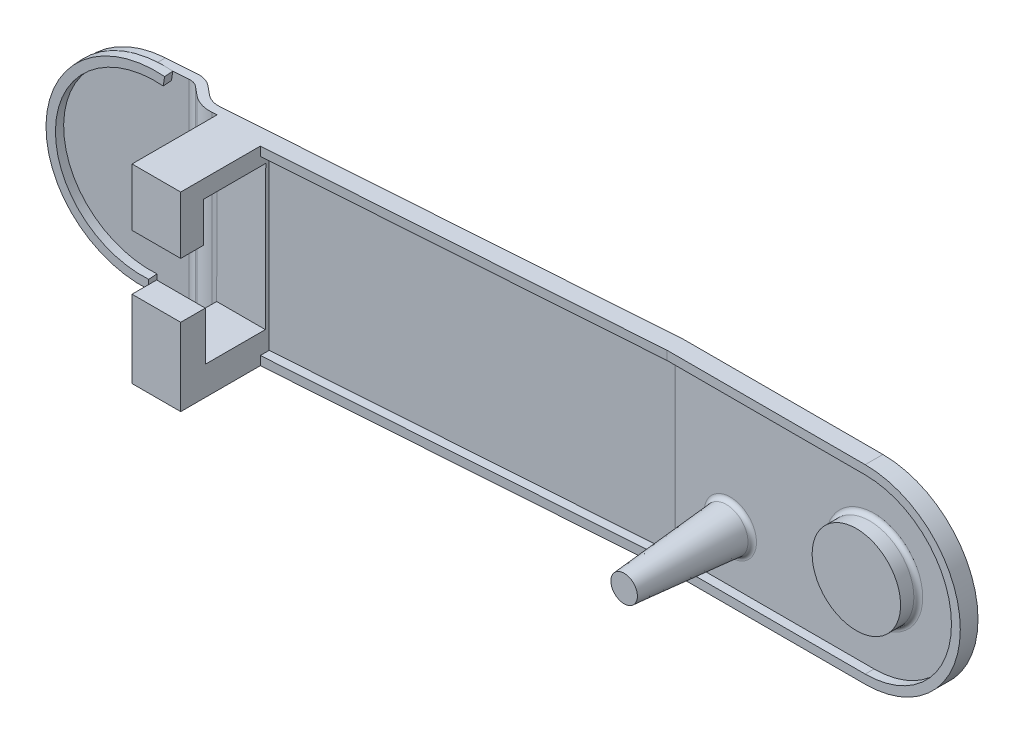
ISO-10303-21;
HEADER;
FILE_DESCRIPTION(('STEP AP214'),'2;1');
FILE_NAME('part.step','',(''),(''),'','','');
FILE_SCHEMA(('AUTOMOTIVE_DESIGN { 1 0 10303 214 1 1 1 1 }'));
ENDSEC;
DATA;
#1=APPLICATION_CONTEXT('core data for automotive mechanical design processes');
#2=APPLICATION_PROTOCOL_DEFINITION('international standard','automotive_design',2000,#1);
#3=PRODUCT_CONTEXT('',#1,'mechanical');
#4=PRODUCT('Part','Part','',(#3));
#5=PRODUCT_RELATED_PRODUCT_CATEGORY('part','',(#4));
#6=PRODUCT_DEFINITION_FORMATION('','',#4);
#7=PRODUCT_DEFINITION_CONTEXT('part definition',#1,'design');
#8=PRODUCT_DEFINITION('design','',#6,#7);
#9=PRODUCT_DEFINITION_SHAPE('','',#8);
#10=(LENGTH_UNIT() NAMED_UNIT(*) SI_UNIT(.MILLI.,.METRE.));
#11=(NAMED_UNIT(*) PLANE_ANGLE_UNIT() SI_UNIT($,.RADIAN.));
#12=(NAMED_UNIT(*) SI_UNIT($,.STERADIAN.) SOLID_ANGLE_UNIT());
#13=UNCERTAINTY_MEASURE_WITH_UNIT(LENGTH_MEASURE(1.E-05),#10,'distance_accuracy_value','');
#14=(GEOMETRIC_REPRESENTATION_CONTEXT(3) GLOBAL_UNCERTAINTY_ASSIGNED_CONTEXT((#13)) GLOBAL_UNIT_ASSIGNED_CONTEXT((#10,
#11,#12)) REPRESENTATION_CONTEXT('',''));
#15=CARTESIAN_POINT('',(0.,0.,0.));
#16=DIRECTION('',(0.,0.,1.));
#17=DIRECTION('',(1.,0.,0.));
#18=AXIS2_PLACEMENT_3D('',#15,#16,#17);
#19=CARTESIAN_POINT('',(-317.220974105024,-43.0002650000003,10.8925355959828));
#20=DIRECTION('',(-0.0697564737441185,0.,-0.997564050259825));
#21=DIRECTION('',(-0.997564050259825,0.,0.0697564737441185));
#22=AXIS2_PLACEMENT_3D('',#19,#20,#21);
#23=PLANE('',#22);
#24=DIRECTION('',(0.154678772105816,0.987905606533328,-0.0108161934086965));
#25=VECTOR('',#24,1.);
#26=CARTESIAN_POINT('',(-310.611319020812,43.,10.4303434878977));
#27=LINE('',#26,#25);
#28=CARTESIAN_POINT('',(-311.230034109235,39.0483775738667,10.4736082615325));
#29=VERTEX_POINT('',#28);
#30=CARTESIAN_POINT('',(-310.611319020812,42.9999999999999,10.4303434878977));
#31=VERTEX_POINT('',#30);
#32=EDGE_CURVE('E50',#29,#31,#27,.T.);
#33=ORIENTED_EDGE('',*,*,#32,.F.);
#34=CARTESIAN_POINT('',(-317.343933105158,0.,10.9011337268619));
#35=DIRECTION('',(-0.0697564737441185,0.,-0.997564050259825));
#36=DIRECTION('',(0.997564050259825,0.,-0.0697564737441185));
#37=AXIS2_PLACEMENT_3D('',#34,#35,#36);
#38=CIRCLE('',#37,39.5264257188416);
#39=CARTESIAN_POINT('',(-317.343933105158,-39.5264257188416,10.9011337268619));
#40=VERTEX_POINT('',#39);
#41=EDGE_CURVE('E1370',#40,#29,#38,.T.);
#42=ORIENTED_EDGE('',*,*,#41,.F.);
#43=DIRECTION('',(0.,1.,0.));
#44=VECTOR('',#43,1.);
#45=CARTESIAN_POINT('',(-317.343933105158,-43.0002650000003,10.9011337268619));
#46=LINE('',#45,#44);
#47=CARTESIAN_POINT('',(-317.343933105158,-42.9999999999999,10.9011337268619));
#48=VERTEX_POINT('',#47);
#49=EDGE_CURVE('E11',#48,#40,#46,.T.);
#50=ORIENTED_EDGE('',*,*,#49,.F.);
#51=DIRECTION('',(-0.997564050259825,0.,0.0697564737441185));
#52=VECTOR('',#51,1.);
#53=CARTESIAN_POINT('',(-90.6260216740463,-43.,-4.9525270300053));
#54=LINE('',#53,#52);
#55=CARTESIAN_POINT('',(-303.722638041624,-42.9999999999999,9.94863998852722));
#56=VERTEX_POINT('',#55);
#57=EDGE_CURVE('E511',#56,#48,#54,.T.);
#58=ORIENTED_EDGE('',*,*,#57,.F.);
#59=DIRECTION('',(0.,1.,0.));
#60=VECTOR('',#59,1.);
#61=CARTESIAN_POINT('',(-303.722638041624,-43.0002650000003,9.94863998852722));
#62=LINE('',#61,#60);
#63=CARTESIAN_POINT('',(-303.722638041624,42.9999999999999,9.94863998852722));
#64=VERTEX_POINT('',#63);
#65=EDGE_CURVE('E498',#56,#64,#62,.T.);
#66=ORIENTED_EDGE('',*,*,#65,.T.);
#67=DIRECTION('',(-0.997564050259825,0.,0.0697564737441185));
#68=VECTOR('',#67,1.);
#69=CARTESIAN_POINT('',(-317.220974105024,42.9999999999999,10.8925355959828));
#70=LINE('',#69,#68);
#71=EDGE_CURVE('E495',#64,#31,#70,.T.);
#72=ORIENTED_EDGE('',*,*,#71,.T.);
#73=EDGE_LOOP('',(#33,#42,#50,#58,#66,#72));
#74=FACE_BOUND('',#73,.T.);
#75=ADVANCED_FACE('F35',(#74),#23,.F.);
#76=CARTESIAN_POINT('',(0.,0.,4.));
#77=DIRECTION('',(0.,0.,1.));
#78=DIRECTION('',(1.,0.,0.));
#79=AXIS2_PLACEMENT_3D('',#76,#77,#78);
#80=PLANE('',#79);
#81=CARTESIAN_POINT('',(0.,0.,4.));
#82=DIRECTION('',(0.,0.,1.));
#83=DIRECTION('',(1.,0.,0.));
#84=AXIS2_PLACEMENT_3D('',#81,#82,#83);
#85=CIRCLE('',#84,22.);
#86=CARTESIAN_POINT('',(22.,0.,4.));
#87=VERTEX_POINT('',#86);
#88=EDGE_CURVE('E881',#87,#87,#85,.F.);
#89=ORIENTED_EDGE('',*,*,#88,.T.);
#90=EDGE_LOOP('',(#89));
#91=FACE_BOUND('',#90,.T.);
#92=CARTESIAN_POINT('',(-65.,-16.,4.));
#93=DIRECTION('',(0.,0.,1.));
#94=DIRECTION('',(1.,0.,0.));
#95=AXIS2_PLACEMENT_3D('',#92,#93,#94);
#96=CIRCLE('',#95,11.8402657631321);
#97=CARTESIAN_POINT('',(-53.1597342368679,-16.,4.));
#98=VERTEX_POINT('',#97);
#99=EDGE_CURVE('E691',#98,#98,#96,.F.);
#100=ORIENTED_EDGE('',*,*,#99,.T.);
#101=EDGE_LOOP('',(#100));
#102=FACE_BOUND('',#101,.T.);
#103=DIRECTION('',(1.,0.,0.));
#104=VECTOR('',#103,1.);
#105=CARTESIAN_POINT('',(0.,-39.,4.));
#106=LINE('',#105,#104);
#107=CARTESIAN_POINT('',(-89.721030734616,-39.,4.));
#108=VERTEX_POINT('',#107);
#109=CARTESIAN_POINT('',(0.,-39.,4.));
#110=VERTEX_POINT('',#109);
#111=EDGE_CURVE('E398',#108,#110,#106,.T.);
#112=ORIENTED_EDGE('',*,*,#111,.T.);
#113=CARTESIAN_POINT('',(0.,0.,4.));
#114=DIRECTION('',(0.,0.,-1.));
#115=DIRECTION('',(-1.,0.,0.));
#116=AXIS2_PLACEMENT_3D('',#113,#114,#115);
#117=CIRCLE('',#116,39.);
#118=CARTESIAN_POINT('',(0.,39.,4.));
#119=VERTEX_POINT('',#118);
#120=EDGE_CURVE('E352',#119,#110,#117,.T.);
#121=ORIENTED_EDGE('',*,*,#120,.F.);
#122=DIRECTION('',(-1.,0.,0.));
#123=VECTOR('',#122,1.);
#124=CARTESIAN_POINT('',(0.,39.,4.));
#125=LINE('',#124,#123);
#126=CARTESIAN_POINT('',(-89.721030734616,39.,4.));
#127=VERTEX_POINT('',#126);
#128=EDGE_CURVE('E422',#119,#127,#125,.T.);
#129=ORIENTED_EDGE('',*,*,#128,.T.);
#130=DIRECTION('',(0.,1.,0.));
#131=VECTOR('',#130,1.);
#132=CARTESIAN_POINT('',(-89.721030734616,0.,4.));
#133=LINE('',#132,#131);
#134=EDGE_CURVE('E500',#108,#127,#133,.T.);
#135=ORIENTED_EDGE('',*,*,#134,.F.);
#136=EDGE_LOOP('',(#112,#121,#129,#135));
#137=FACE_BOUND('',#136,.T.);
#138=ADVANCED_FACE('F565',(#91,#102,#137),#80,.T.);
#139=DIRECTION('',(0.,-1.,0.));
#140=VECTOR('',#139,1.);
#141=CARTESIAN_POINT('',(-90.,43.,4.));
#142=LINE('',#141,#140);
#143=CARTESIAN_POINT('',(-90.,43.,4.));
#144=VERTEX_POINT('',#143);
#145=CARTESIAN_POINT('',(-90.,-39.,4.));
#146=VERTEX_POINT('',#145);
#147=EDGE_CURVE('E636',#144,#146,#142,.T.);
#148=ORIENTED_EDGE('',*,*,#147,.T.);
#149=DIRECTION('',(-1.,0.,0.));
#150=VECTOR('',#149,1.);
#151=CARTESIAN_POINT('',(-90.,-39.,4.));
#152=LINE('',#151,#150);
#153=CARTESIAN_POINT('',(-89.860316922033,-39.,4.));
#154=VERTEX_POINT('',#153);
#155=EDGE_CURVE('E361',#154,#146,#152,.T.);
#156=ORIENTED_EDGE('',*,*,#155,.F.);
#157=DIRECTION('',(0.,-1.,0.));
#158=VECTOR('',#157,1.);
#159=CARTESIAN_POINT('',(-89.860316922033,0.,4.));
#160=LINE('',#159,#158);
#161=CARTESIAN_POINT('',(-89.860316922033,39.,4.));
#162=VERTEX_POINT('',#161);
#163=EDGE_CURVE('E515',#162,#154,#160,.T.);
#164=ORIENTED_EDGE('',*,*,#163,.F.);
#165=CARTESIAN_POINT('',(-89.860316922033,43.,4.));
#166=VERTEX_POINT('',#165);
#167=EDGE_CURVE('E516',#166,#162,#160,.T.);
#168=ORIENTED_EDGE('',*,*,#167,.F.);
#169=DIRECTION('',(-1.,0.,0.));
#170=VECTOR('',#169,1.);
#171=CARTESIAN_POINT('',(0.,43.,4.));
#172=LINE('',#171,#170);
#173=EDGE_CURVE('E633',#166,#144,#172,.T.);
#174=ORIENTED_EDGE('',*,*,#173,.T.);
#175=EDGE_LOOP('',(#148,#156,#164,#168,#174));
#176=FACE_BOUND('',#175,.T.);
#177=ADVANCED_FACE('F570',(#176),#80,.T.);
#178=CARTESIAN_POINT('',(-90.,0.,52.));
#179=DIRECTION('',(1.,0.,0.));
#180=DIRECTION('',(0.,0.,-1.));
#181=AXIS2_PLACEMENT_3D('',#178,#179,#180);
#182=PLANE('',#181);
#183=DIRECTION('',(0.,1.,0.));
#184=VECTOR('',#183,1.);
#185=CARTESIAN_POINT('',(-90.,0.,4.00976759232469));
#186=LINE('',#185,#184);
#187=CARTESIAN_POINT('',(-90.,-39.,4.00976759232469));
#188=VERTEX_POINT('',#187);
#189=CARTESIAN_POINT('',(-90.,39.,4.00976759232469));
#190=VERTEX_POINT('',#189);
#191=EDGE_CURVE('E649',#188,#190,#186,.T.);
#192=ORIENTED_EDGE('',*,*,#191,.F.);
#193=DIRECTION('',(0.,0.,-1.));
#194=VECTOR('',#193,1.);
#195=CARTESIAN_POINT('',(-90.,-39.,8.));
#196=LINE('',#195,#194);
#197=EDGE_CURVE('E368',#188,#146,#196,.T.);
#198=ORIENTED_EDGE('',*,*,#197,.T.);
#199=ORIENTED_EDGE('',*,*,#147,.F.);
#200=DIRECTION('',(0.,0.,-1.));
#201=VECTOR('',#200,1.);
#202=CARTESIAN_POINT('',(-90.,43.,52.));
#203=LINE('',#202,#201);
#204=CARTESIAN_POINT('',(-90.,43.,4.00976759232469));
#205=VERTEX_POINT('',#204);
#206=EDGE_CURVE('E631',#205,#144,#203,.T.);
#207=ORIENTED_EDGE('',*,*,#206,.F.);
#208=DIRECTION('',(0.,-1.,0.));
#209=VECTOR('',#208,1.);
#210=CARTESIAN_POINT('',(-90.,0.,4.00976759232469));
#211=LINE('',#210,#209);
#212=EDGE_CURVE('E416',#205,#190,#211,.T.);
#213=ORIENTED_EDGE('',*,*,#212,.T.);
#214=EDGE_LOOP('',(#192,#198,#199,#207,#213));
#215=FACE_BOUND('',#214,.T.);
#216=ADVANCED_FACE('F590',(#215),#182,.T.);
#217=CARTESIAN_POINT('',(-89.7209741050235,-43.0002650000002,3.9902562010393));
#218=DIRECTION('',(-0.0697564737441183,0.,-0.997564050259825));
#219=DIRECTION('',(-0.997564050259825,0.,0.0697564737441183));
#220=AXIS2_PLACEMENT_3D('',#217,#218,#219);
#221=PLANE('',#220);
#222=DIRECTION('',(-0.997564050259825,0.,0.0697564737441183));
#223=VECTOR('',#222,1.);
#224=CARTESIAN_POINT('',(-266.689893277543,-39.,16.3651285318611));
#225=LINE('',#224,#223);
#226=CARTESIAN_POINT('',(-261.5,-39.,16.0022158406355));
#227=VERTEX_POINT('',#226);
#228=EDGE_CURVE('E384',#188,#227,#225,.T.);
#229=ORIENTED_EDGE('',*,*,#228,.F.);
#230=ORIENTED_EDGE('',*,*,#191,.T.);
#231=DIRECTION('',(0.997564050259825,0.,-0.0697564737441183));
#232=VECTOR('',#231,1.);
#233=CARTESIAN_POINT('',(-266.689893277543,39.,16.3651285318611));
#234=LINE('',#233,#232);
#235=CARTESIAN_POINT('',(-261.5,39.,16.0022158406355));
#236=VERTEX_POINT('',#235);
#237=EDGE_CURVE('E407',#236,#190,#234,.T.);
#238=ORIENTED_EDGE('',*,*,#237,.F.);
#239=DIRECTION('',(0.,1.,0.));
#240=VECTOR('',#239,1.);
#241=CARTESIAN_POINT('',(-261.5,-43.0002650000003,16.0022158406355));
#242=LINE('',#241,#240);
#243=EDGE_CURVE('E703',#227,#236,#242,.T.);
#244=ORIENTED_EDGE('',*,*,#243,.F.);
#245=EDGE_LOOP('',(#229,#230,#238,#244));
#246=FACE_BOUND('',#245,.T.);
#247=ADVANCED_FACE('F562',(#246),#221,.F.);
#248=CARTESIAN_POINT('',(-89.7209741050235,-39.,3.9902562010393));
#249=VERTEX_POINT('',#248);
#250=EDGE_CURVE('E387',#249,#154,#225,.T.);
#251=ORIENTED_EDGE('',*,*,#250,.F.);
#252=DIRECTION('',(0.,1.,0.));
#253=VECTOR('',#252,1.);
#254=CARTESIAN_POINT('',(-89.7209741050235,-43.0002650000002,3.9902562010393));
#255=LINE('',#254,#253);
#256=CARTESIAN_POINT('',(-89.7209741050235,39.,3.9902562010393));
#257=VERTEX_POINT('',#256);
#258=EDGE_CURVE('E497',#249,#257,#255,.T.);
#259=ORIENTED_EDGE('',*,*,#258,.T.);
#260=EDGE_CURVE('E403',#162,#257,#234,.T.);
#261=ORIENTED_EDGE('',*,*,#260,.F.);
#262=ORIENTED_EDGE('',*,*,#163,.T.);
#263=EDGE_LOOP('',(#251,#259,#261,#262));
#264=FACE_BOUND('',#263,.T.);
#265=ADVANCED_FACE('F563',(#264),#221,.F.);
#266=CARTESIAN_POINT('',(-89.7209741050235,-43.0002650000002,3.9902562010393));
#267=DIRECTION('',(0.999983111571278,0.,0.00581176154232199));
#268=DIRECTION('',(0.00581176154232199,0.,-0.999983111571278));
#269=AXIS2_PLACEMENT_3D('',#266,#267,#268);
#270=PLANE('',#269);
#271=DIRECTION('',(0.00581176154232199,0.,-0.999983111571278));
#272=VECTOR('',#271,1.);
#273=CARTESIAN_POINT('',(-89.7209741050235,-39.,3.9902562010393));
#274=LINE('',#273,#272);
#275=EDGE_CURVE('E396',#108,#249,#274,.T.);
#276=ORIENTED_EDGE('',*,*,#275,.F.);
#277=ORIENTED_EDGE('',*,*,#134,.T.);
#278=DIRECTION('',(-0.00581176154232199,0.,0.999983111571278));
#279=VECTOR('',#278,1.);
#280=CARTESIAN_POINT('',(-89.7209741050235,39.,3.99025620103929));
#281=LINE('',#280,#279);
#282=EDGE_CURVE('E419',#257,#127,#281,.T.);
#283=ORIENTED_EDGE('',*,*,#282,.F.);
#284=ORIENTED_EDGE('',*,*,#258,.F.);
#285=EDGE_LOOP('',(#276,#277,#283,#284));
#286=FACE_BOUND('',#285,.T.);
#287=ADVANCED_FACE('F592',(#286),#270,.F.);
#288=CARTESIAN_POINT('',(-261.5,43.,56.));
#289=DIRECTION('',(-1.,0.,0.));
#290=DIRECTION('',(0.,-1.,0.));
#291=AXIS2_PLACEMENT_3D('',#288,#289,#290);
#292=PLANE('',#291);
#293=DIRECTION('',(0.,0.,1.));
#294=VECTOR('',#293,1.);
#295=CARTESIAN_POINT('',(-261.5,-39.,56.));
#296=LINE('',#295,#294);
#297=CARTESIAN_POINT('',(-261.5,-39.,20.0119834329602));
#298=VERTEX_POINT('',#297);
#299=EDGE_CURVE('E393',#227,#298,#296,.T.);
#300=ORIENTED_EDGE('',*,*,#299,.F.);
#301=ORIENTED_EDGE('',*,*,#243,.T.);
#302=DIRECTION('',(0.,0.,-1.));
#303=VECTOR('',#302,1.);
#304=CARTESIAN_POINT('',(-261.5,39.,56.));
#305=LINE('',#304,#303);
#306=CARTESIAN_POINT('',(-261.5,39.,20.0119834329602));
#307=VERTEX_POINT('',#306);
#308=EDGE_CURVE('E730',#307,#236,#305,.T.);
#309=ORIENTED_EDGE('',*,*,#308,.F.);
#310=DIRECTION('',(0.,1.,0.));
#311=VECTOR('',#310,1.);
#312=CARTESIAN_POINT('',(-261.5,43.,20.0119834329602));
#313=LINE('',#312,#311);
#314=CARTESIAN_POINT('',(-261.5,43.,20.0119834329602));
#315=VERTEX_POINT('',#314);
#316=EDGE_CURVE('E727',#307,#315,#313,.T.);
#317=ORIENTED_EDGE('',*,*,#316,.T.);
#318=DIRECTION('',(0.,0.,-1.));
#319=VECTOR('',#318,1.);
#320=CARTESIAN_POINT('',(-261.5,43.,56.));
#321=LINE('',#320,#319);
#322=CARTESIAN_POINT('',(-261.5,43.,56.));
#323=VERTEX_POINT('',#322);
#324=EDGE_CURVE('E480',#323,#315,#321,.T.);
#325=ORIENTED_EDGE('',*,*,#324,.F.);
#326=DIRECTION('',(0.,1.,0.));
#327=VECTOR('',#326,1.);
#328=CARTESIAN_POINT('',(-261.5,43.,56.));
#329=LINE('',#328,#327);
#330=CARTESIAN_POINT('',(-261.5,17.,56.));
#331=VERTEX_POINT('',#330);
#332=EDGE_CURVE('E448',#331,#323,#329,.T.);
#333=ORIENTED_EDGE('',*,*,#332,.F.);
#334=DIRECTION('',(0.,0.,-1.));
#335=VECTOR('',#334,1.);
#336=CARTESIAN_POINT('',(-261.5,17.,56.));
#337=LINE('',#336,#335);
#338=CARTESIAN_POINT('',(-261.5,17.,45.6389563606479));
#339=VERTEX_POINT('',#338);
#340=EDGE_CURVE('E706',#331,#339,#337,.T.);
#341=ORIENTED_EDGE('',*,*,#340,.T.);
#342=DIRECTION('',(0.,1.,0.));
#343=VECTOR('',#342,1.);
#344=CARTESIAN_POINT('',(-261.5,43.,45.6389563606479));
#345=LINE('',#344,#343);
#346=CARTESIAN_POINT('',(-261.5,35.,45.6389563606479));
#347=VERTEX_POINT('',#346);
#348=EDGE_CURVE('E709',#339,#347,#345,.T.);
#349=ORIENTED_EDGE('',*,*,#348,.T.);
#350=DIRECTION('',(0.,0.,-1.));
#351=VECTOR('',#350,1.);
#352=CARTESIAN_POINT('',(-261.5,35.,56.));
#353=LINE('',#352,#351);
#354=CARTESIAN_POINT('',(-261.5,35.,17.5406057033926));
#355=VERTEX_POINT('',#354);
#356=EDGE_CURVE('E712',#347,#355,#353,.T.);
#357=ORIENTED_EDGE('',*,*,#356,.T.);
#358=DIRECTION('',(0.,-0.999995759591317,0.00291218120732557));
#359=VECTOR('',#358,1.);
#360=CARTESIAN_POINT('',(-261.5,42.887931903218,17.5176345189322));
#361=LINE('',#360,#359);
#362=CARTESIAN_POINT('',(-261.5,-30.,17.7298982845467));
#363=VERTEX_POINT('',#362);
#364=EDGE_CURVE('E715',#355,#363,#361,.T.);
#365=ORIENTED_EDGE('',*,*,#364,.T.);
#366=DIRECTION('',(0.,0.,1.));
#367=VECTOR('',#366,1.);
#368=CARTESIAN_POINT('',(-261.5,-30.,56.));
#369=LINE('',#368,#367);
#370=CARTESIAN_POINT('',(-261.5,-30.,44.8924085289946));
#371=VERTEX_POINT('',#370);
#372=EDGE_CURVE('E718',#363,#371,#369,.T.);
#373=ORIENTED_EDGE('',*,*,#372,.T.);
#374=DIRECTION('',(0.,1.,0.));
#375=VECTOR('',#374,1.);
#376=CARTESIAN_POINT('',(-261.5,43.,44.8924085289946));
#377=LINE('',#376,#375);
#378=CARTESIAN_POINT('',(-261.5,-7.99999999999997,44.8924085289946));
#379=VERTEX_POINT('',#378);
#380=EDGE_CURVE('E721',#371,#379,#377,.T.);
#381=ORIENTED_EDGE('',*,*,#380,.T.);
#382=DIRECTION('',(0.,0.,1.));
#383=VECTOR('',#382,1.);
#384=CARTESIAN_POINT('',(-261.5,-7.99999999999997,56.));
#385=LINE('',#384,#383);
#386=CARTESIAN_POINT('',(-261.5,-7.99999999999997,56.));
#387=VERTEX_POINT('',#386);
#388=EDGE_CURVE('E724',#379,#387,#385,.T.);
#389=ORIENTED_EDGE('',*,*,#388,.T.);
#390=CARTESIAN_POINT('',(-261.5,-43.,56.));
#391=VERTEX_POINT('',#390);
#392=EDGE_CURVE('E462',#391,#387,#329,.T.);
#393=ORIENTED_EDGE('',*,*,#392,.F.);
#394=DIRECTION('',(0.,0.,-1.));
#395=VECTOR('',#394,1.);
#396=CARTESIAN_POINT('',(-261.5,-43.,56.));
#397=LINE('',#396,#395);
#398=CARTESIAN_POINT('',(-261.5,-43.,20.0119834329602));
#399=VERTEX_POINT('',#398);
#400=EDGE_CURVE('E473',#391,#399,#397,.T.);
#401=ORIENTED_EDGE('',*,*,#400,.T.);
#402=DIRECTION('',(0.,-1.,0.));
#403=VECTOR('',#402,1.);
#404=CARTESIAN_POINT('',(-261.5,43.,20.0119834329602));
#405=LINE('',#404,#403);
#406=EDGE_CURVE('E400',#298,#399,#405,.T.);
#407=ORIENTED_EDGE('',*,*,#406,.F.);
#408=EDGE_LOOP('',(#300,#301,#309,#317,#325,#333,#341,#349,#357,#365,#373,#381,#389,#393,#401,#407));
#409=FACE_BOUND('',#408,.T.);
#410=ADVANCED_FACE('F575',(#409),#292,.F.);
#411=CARTESIAN_POINT('',(-261.5,-43.,56.));
#412=DIRECTION('',(0.,0.,-1.));
#413=DIRECTION('',(-1.,0.,0.));
#414=AXIS2_PLACEMENT_3D('',#411,#412,#413);
#415=PLANE('',#414);
#416=ORIENTED_EDGE('',*,*,#392,.T.);
#417=DIRECTION('',(-1.,0.,0.));
#418=VECTOR('',#417,1.);
#419=CARTESIAN_POINT('',(-231.5,-7.99999999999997,56.));
#420=LINE('',#419,#418);
#421=CARTESIAN_POINT('',(-283.5,-7.99999999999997,56.));
#422=VERTEX_POINT('',#421);
#423=EDGE_CURVE('E445',#387,#422,#420,.T.);
#424=ORIENTED_EDGE('',*,*,#423,.T.);
#425=DIRECTION('',(0.,-1.,0.));
#426=VECTOR('',#425,1.);
#427=CARTESIAN_POINT('',(-283.5,43.,56.));
#428=LINE('',#427,#426);
#429=CARTESIAN_POINT('',(-283.5,-43.,56.));
#430=VERTEX_POINT('',#429);
#431=EDGE_CURVE('E467',#422,#430,#428,.T.);
#432=ORIENTED_EDGE('',*,*,#431,.T.);
#433=DIRECTION('',(1.,0.,0.));
#434=VECTOR('',#433,1.);
#435=CARTESIAN_POINT('',(-261.5,-43.,56.));
#436=LINE('',#435,#434);
#437=EDGE_CURVE('E471',#430,#391,#436,.T.);
#438=ORIENTED_EDGE('',*,*,#437,.T.);
#439=EDGE_LOOP('',(#416,#424,#432,#438));
#440=FACE_BOUND('',#439,.T.);
#441=ADVANCED_FACE('F599',(#440),#415,.F.);
#442=CARTESIAN_POINT('',(-283.5,43.,56.));
#443=DIRECTION('',(1.,0.,0.));
#444=DIRECTION('',(0.,0.,-1.));
#445=AXIS2_PLACEMENT_3D('',#442,#443,#444);
#446=PLANE('',#445);
#447=ORIENTED_EDGE('',*,*,#431,.F.);
#448=DIRECTION('',(0.,0.,1.));
#449=VECTOR('',#448,1.);
#450=CARTESIAN_POINT('',(-283.5,-7.99999999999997,44.8924085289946));
#451=LINE('',#450,#449);
#452=CARTESIAN_POINT('',(-283.5,-7.99999999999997,44.8924085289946));
#453=VERTEX_POINT('',#452);
#454=EDGE_CURVE('E442',#453,#422,#451,.T.);
#455=ORIENTED_EDGE('',*,*,#454,.F.);
#456=DIRECTION('',(0.,1.,0.));
#457=VECTOR('',#456,1.);
#458=CARTESIAN_POINT('',(-283.5,-30.,44.8924085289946));
#459=LINE('',#458,#457);
#460=CARTESIAN_POINT('',(-283.5,-30.,44.8924085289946));
#461=VERTEX_POINT('',#460);
#462=EDGE_CURVE('E439',#461,#453,#459,.T.);
#463=ORIENTED_EDGE('',*,*,#462,.F.);
#464=DIRECTION('',(0.,0.,1.));
#465=VECTOR('',#464,1.);
#466=CARTESIAN_POINT('',(-283.5,-30.,17.7298982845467));
#467=LINE('',#466,#465);
#468=CARTESIAN_POINT('',(-283.5,-30.,17.7298982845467));
#469=VERTEX_POINT('',#468);
#470=EDGE_CURVE('E436',#469,#461,#467,.T.);
#471=ORIENTED_EDGE('',*,*,#470,.F.);
#472=DIRECTION('',(0.,-0.999995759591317,0.00291218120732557));
#473=VECTOR('',#472,1.);
#474=CARTESIAN_POINT('',(-283.5,35.,17.5406057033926));
#475=LINE('',#474,#473);
#476=CARTESIAN_POINT('',(-283.5,35.,17.5406057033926));
#477=VERTEX_POINT('',#476);
#478=EDGE_CURVE('E433',#477,#469,#475,.T.);
#479=ORIENTED_EDGE('',*,*,#478,.F.);
#480=DIRECTION('',(0.,-1.,0.));
#481=VECTOR('',#480,1.);
#482=CARTESIAN_POINT('',(-283.5,-43.0002650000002,17.5406057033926));
#483=LINE('',#482,#481);
#484=CARTESIAN_POINT('',(-283.5,-42.9999999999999,17.5406057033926));
#485=VERTEX_POINT('',#484);
#486=EDGE_CURVE('E704',#477,#485,#483,.T.);
#487=ORIENTED_EDGE('',*,*,#486,.T.);
#488=DIRECTION('',(0.,0.,-1.));
#489=VECTOR('',#488,1.);
#490=CARTESIAN_POINT('',(-283.5,-43.,56.));
#491=LINE('',#490,#489);
#492=EDGE_CURVE('E475',#430,#485,#491,.T.);
#493=ORIENTED_EDGE('',*,*,#492,.F.);
#494=EDGE_LOOP('',(#447,#455,#463,#471,#479,#487,#493));
#495=FACE_BOUND('',#494,.T.);
#496=ADVANCED_FACE('F802',(#495),#446,.F.);
#497=CARTESIAN_POINT('',(-285.998336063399,-43.0000500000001,13.7055387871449));
#498=DIRECTION('',(0.0697564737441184,0.,0.997564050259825));
#499=DIRECTION('',(0.997564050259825,0.,-0.0697564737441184));
#500=AXIS2_PLACEMENT_3D('',#497,#498,#499);
#501=PLANE('',#500);
#502=DIRECTION('',(0.997564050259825,0.,-0.0697564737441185));
#503=VECTOR('',#502,1.);
#504=CARTESIAN_POINT('',(-285.998336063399,42.9999999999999,13.7055387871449));
#505=LINE('',#504,#503);
#506=CARTESIAN_POINT('',(-285.998336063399,42.9999999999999,13.7055387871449));
#507=VERTEX_POINT('',#506);
#508=CARTESIAN_POINT('',(-90.,43.,0.));
#509=VERTEX_POINT('',#508);
#510=EDGE_CURVE('E865',#507,#509,#505,.T.);
#511=ORIENTED_EDGE('',*,*,#510,.T.);
#512=DIRECTION('',(0.,1.,0.));
#513=VECTOR('',#512,1.);
#514=CARTESIAN_POINT('',(-90.,-43.00005,0.));
#515=LINE('',#514,#513);
#516=CARTESIAN_POINT('',(-89.9999999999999,-43.0000025,0.));
#517=VERTEX_POINT('',#516);
#518=EDGE_CURVE('E836',#517,#509,#515,.T.);
#519=ORIENTED_EDGE('',*,*,#518,.F.);
#520=DIRECTION('',(0.997564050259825,0.,-0.0697564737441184));
#521=VECTOR('',#520,1.);
#522=CARTESIAN_POINT('',(-90.2783462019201,-43.,0.0194638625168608));
#523=LINE('',#522,#521);
#524=CARTESIAN_POINT('',(-285.998336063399,-42.9999999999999,13.7055387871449));
#525=VERTEX_POINT('',#524);
#526=EDGE_CURVE('E642',#525,#517,#523,.T.);
#527=ORIENTED_EDGE('',*,*,#526,.F.);
#528=DIRECTION('',(0.,1.,0.));
#529=VECTOR('',#528,1.);
#530=CARTESIAN_POINT('',(-285.998336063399,-43.0000500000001,13.7055387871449));
#531=LINE('',#530,#529);
#532=EDGE_CURVE('E829',#525,#507,#531,.T.);
#533=ORIENTED_EDGE('',*,*,#532,.T.);
#534=EDGE_LOOP('',(#511,#519,#527,#533));
#535=FACE_BOUND('',#534,.T.);
#536=ADVANCED_FACE('F559',(#535),#501,.F.);
#537=CARTESIAN_POINT('',(-283.5,43.,17.5406057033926));
#538=VERTEX_POINT('',#537);
#539=EDGE_CURVE('E700',#538,#477,#483,.T.);
#540=ORIENTED_EDGE('',*,*,#539,.F.);
#541=DIRECTION('',(-0.997564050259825,0.,0.0697564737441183));
#542=VECTOR('',#541,1.);
#543=CARTESIAN_POINT('',(-89.7209741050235,43.,3.9902562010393));
#544=LINE('',#543,#542);
#545=CARTESIAN_POINT('',(-285.719310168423,42.9999999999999,17.6957949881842));
#546=VERTEX_POINT('',#545);
#547=EDGE_CURVE('E483',#538,#546,#544,.T.);
#548=ORIENTED_EDGE('',*,*,#547,.T.);
#549=DIRECTION('',(0.,1.,0.));
#550=VECTOR('',#549,1.);
#551=CARTESIAN_POINT('',(-285.719310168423,-43.0002650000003,17.6957949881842));
#552=LINE('',#551,#550);
#553=CARTESIAN_POINT('',(-285.719310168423,-43.,17.6957949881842));
#554=VERTEX_POINT('',#553);
#555=EDGE_CURVE('E505',#554,#546,#552,.T.);
#556=ORIENTED_EDGE('',*,*,#555,.F.);
#557=DIRECTION('',(-0.997564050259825,0.,0.0697564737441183));
#558=VECTOR('',#557,1.);
#559=CARTESIAN_POINT('',(-89.9993203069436,-43.,4.00972006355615));
#560=LINE('',#559,#558);
#561=EDGE_CURVE('E513',#485,#554,#560,.T.);
#562=ORIENTED_EDGE('',*,*,#561,.F.);
#563=ORIENTED_EDGE('',*,*,#486,.F.);
#564=EDGE_LOOP('',(#540,#548,#556,#562,#563));
#565=FACE_BOUND('',#564,.T.);
#566=ADVANCED_FACE('F551',(#565),#221,.F.);
#567=CARTESIAN_POINT('',(-296.914307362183,-43.0000500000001,8.24178402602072));
#568=DIRECTION('',(-0.638979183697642,0.,0.769224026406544));
#569=DIRECTION('',(0.769224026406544,0.,0.638979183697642));
#570=AXIS2_PLACEMENT_3D('',#567,#568,#569);
#571=PLANE('',#570);
#572=CARTESIAN_POINT('',(-317.5,0.,-8.85834366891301));
#573=DIRECTION('',(-0.638979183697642,0.,0.769224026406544));
#574=DIRECTION('',(-0.769224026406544,0.,-0.638979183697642));
#575=AXIS2_PLACEMENT_3D('',#572,#573,#574);
#576=ELLIPSE('',#575,29.2502563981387,22.5);
#577=CARTESIAN_POINT('',(-296.914307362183,9.08180921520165,8.24178402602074));
#578=VERTEX_POINT('',#577);
#579=CARTESIAN_POINT('',(-296.914307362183,-9.08180921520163,8.24178402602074));
#580=VERTEX_POINT('',#579);
#581=EDGE_CURVE('E531',#578,#580,#576,.F.);
#582=ORIENTED_EDGE('',*,*,#581,.F.);
#583=DIRECTION('',(0.,1.,0.));
#584=VECTOR('',#583,1.);
#585=CARTESIAN_POINT('',(-296.914307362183,-43.0000500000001,8.24178402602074));
#586=LINE('',#585,#584);
#587=CARTESIAN_POINT('',(-296.914307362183,42.9999999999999,8.24178402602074));
#588=VERTEX_POINT('',#587);
#589=EDGE_CURVE('E858',#578,#588,#586,.T.);
#590=ORIENTED_EDGE('',*,*,#589,.T.);
#591=DIRECTION('',(0.769224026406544,0.,0.638979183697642));
#592=VECTOR('',#591,1.);
#593=CARTESIAN_POINT('',(-296.914307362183,42.9999999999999,8.24178402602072));
#594=LINE('',#593,#592);
#595=CARTESIAN_POINT('',(-293.085692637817,42.9999999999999,11.4221385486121));
#596=VERTEX_POINT('',#595);
#597=EDGE_CURVE('E846',#588,#596,#594,.T.);
#598=ORIENTED_EDGE('',*,*,#597,.T.);
#599=DIRECTION('',(0.,1.,0.));
#600=VECTOR('',#599,1.);
#601=CARTESIAN_POINT('',(-293.085692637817,-43.0000500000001,11.4221385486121));
#602=LINE('',#601,#600);
#603=CARTESIAN_POINT('',(-293.085692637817,-42.9999999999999,11.4221385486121));
#604=VERTEX_POINT('',#603);
#605=EDGE_CURVE('E831',#604,#596,#602,.T.);
#606=ORIENTED_EDGE('',*,*,#605,.F.);
#607=DIRECTION('',(0.769224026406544,0.,0.638979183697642));
#608=VECTOR('',#607,1.);
#609=CARTESIAN_POINT('',(-176.566866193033,-43.,108.212022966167));
#610=LINE('',#609,#608);
#611=CARTESIAN_POINT('',(-296.914307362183,-42.9999999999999,8.24178402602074));
#612=VERTEX_POINT('',#611);
#613=EDGE_CURVE('E680',#612,#604,#610,.T.);
#614=ORIENTED_EDGE('',*,*,#613,.F.);
#615=EDGE_CURVE('E856',#612,#580,#586,.T.);
#616=ORIENTED_EDGE('',*,*,#615,.T.);
#617=EDGE_LOOP('',(#582,#590,#598,#606,#614,#616));
#618=FACE_BOUND('',#617,.T.);
#619=ADVANCED_FACE('F549',(#618),#571,.F.);
#620=CARTESIAN_POINT('',(-303.304099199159,-43.0000500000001,15.9340242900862));
#621=DIRECTION('',(0.,1.,0.));
#622=DIRECTION('',(-1.,0.,0.));
#623=AXIS2_PLACEMENT_3D('',#620,#621,#622);
#624=CYLINDRICAL_SURFACE('',#623,10.);
#625=CARTESIAN_POINT('',(-312.002110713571,21.8179562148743,11.));
#626=CARTESIAN_POINT('',(-311.869910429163,21.7846352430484,10.766856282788));
#627=CARTESIAN_POINT('',(-311.728478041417,21.7477262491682,10.5394565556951));
#628=CARTESIAN_POINT('',(-311.428627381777,21.6659334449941,10.0976670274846));
#629=CARTESIAN_POINT('',(-311.270209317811,21.6210497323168,9.88327706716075));
#630=CARTESIAN_POINT('',(-310.938219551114,21.5226138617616,9.46946850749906));
#631=CARTESIAN_POINT('',(-310.764681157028,21.4690805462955,9.27001871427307));
#632=CARTESIAN_POINT('',(-310.403912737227,21.3525518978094,8.88690726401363));
#633=CARTESIAN_POINT('',(-310.216683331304,21.2895569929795,8.70324489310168));
#634=CARTESIAN_POINT('',(-309.830261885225,21.1534183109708,8.35264368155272));
#635=CARTESIAN_POINT('',(-309.631058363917,21.0802647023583,8.18572131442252));
#636=CARTESIAN_POINT('',(-309.222941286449,20.9233860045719,7.86966298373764));
#637=CARTESIAN_POINT('',(-309.014027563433,20.839660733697,7.72052732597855));
#638=CARTESIAN_POINT('',(-308.588755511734,20.6613855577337,7.44066314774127));
#639=CARTESIAN_POINT('',(-308.372399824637,20.5668394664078,7.30992817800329));
#640=CARTESIAN_POINT('',(-307.93438561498,20.3668108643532,7.06705384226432));
#641=CARTESIAN_POINT('',(-307.712727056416,20.2613282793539,6.95491460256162));
#642=CARTESIAN_POINT('',(-307.264179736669,20.0384948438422,6.74820278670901));
#643=CARTESIAN_POINT('',(-307.037261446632,19.9210422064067,6.65380434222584));
#644=CARTESIAN_POINT('',(-306.582327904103,19.6753975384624,6.48351021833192));
#645=CARTESIAN_POINT('',(-306.354312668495,19.547205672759,6.40761425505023));
#646=CARTESIAN_POINT('',(-305.89896749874,19.2804486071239,6.27364064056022));
#647=CARTESIAN_POINT('',(-305.671637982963,19.1418780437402,6.21557228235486));
#648=CARTESIAN_POINT('',(-305.219436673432,18.854960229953,6.11643342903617));
#649=CARTESIAN_POINT('',(-304.994565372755,18.7066110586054,6.07536628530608));
#650=CARTESIAN_POINT('',(-304.465067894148,18.3433535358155,5.99681272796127));
#651=CARTESIAN_POINT('',(-304.162171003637,18.1243545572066,5.96644989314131));
#652=CARTESIAN_POINT('',(-303.566749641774,17.6707321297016,5.933023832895));
#653=CARTESIAN_POINT('',(-303.274228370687,17.436103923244,5.9299689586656));
#654=CARTESIAN_POINT('',(-302.701342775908,16.9525937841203,5.9480875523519));
#655=CARTESIAN_POINT('',(-302.42099654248,16.7036918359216,5.96929587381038));
#656=CARTESIAN_POINT('',(-301.874401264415,16.1935330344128,6.03292895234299));
#657=CARTESIAN_POINT('',(-301.608152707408,15.9322757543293,6.07535444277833));
#658=CARTESIAN_POINT('',(-300.983298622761,15.2880647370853,6.19989621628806));
#659=CARTESIAN_POINT('',(-300.632194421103,14.8995833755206,6.2911765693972));
#660=CARTESIAN_POINT('',(-299.961381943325,14.1038304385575,6.50269255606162));
#661=CARTESIAN_POINT('',(-299.641687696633,13.6965505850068,6.62294104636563));
#662=CARTESIAN_POINT('',(-299.033705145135,12.8651307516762,6.88562507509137));
#663=CARTESIAN_POINT('',(-298.74546479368,12.4409663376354,7.02809370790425));
#664=CARTESIAN_POINT('',(-298.200853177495,11.5781361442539,7.32858523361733));
#665=CARTESIAN_POINT('',(-297.944477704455,11.1394722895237,7.48660606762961));
#666=CARTESIAN_POINT('',(-297.452023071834,10.2278720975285,7.81949776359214));
#667=CARTESIAN_POINT('',(-297.217440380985,9.75429034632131,7.99481039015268));
#668=CARTESIAN_POINT('',(-296.782400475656,8.79259484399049,8.34811918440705));
#669=CARTESIAN_POINT('',(-296.581950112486,8.30447819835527,8.52611588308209));
#670=CARTESIAN_POINT('',(-296.215228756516,7.31352066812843,8.87625816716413));
#671=CARTESIAN_POINT('',(-296.048951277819,6.81068259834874,9.04840485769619));
#672=CARTESIAN_POINT('',(-295.825641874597,6.04506159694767,9.29437056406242));
#673=CARTESIAN_POINT('',(-295.755564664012,5.78799802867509,9.37430623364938));
#674=CARTESIAN_POINT('',(-295.624218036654,5.26987892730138,9.52858305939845));
#675=CARTESIAN_POINT('',(-295.562951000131,5.00882233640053,9.60292270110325));
#676=CARTESIAN_POINT('',(-295.42463790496,4.36782330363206,9.77520493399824));
#677=CARTESIAN_POINT('',(-295.352392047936,3.98576852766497,9.86927034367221));
#678=CARTESIAN_POINT('',(-295.227325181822,3.21412582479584,10.0368473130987));
#679=CARTESIAN_POINT('',(-295.174496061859,2.82454111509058,10.1103674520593));
#680=CARTESIAN_POINT('',(-295.089306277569,2.04091088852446,10.2311587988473));
#681=CARTESIAN_POINT('',(-295.056849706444,1.64689529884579,10.2785528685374));
#682=CARTESIAN_POINT('',(-295.012766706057,0.855229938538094,10.3433716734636));
#683=CARTESIAN_POINT('',(-295.001137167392,0.457580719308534,10.3608008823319));
#684=CARTESIAN_POINT('',(-294.999017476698,-0.339594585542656,10.3639590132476));
#685=CARTESIAN_POINT('',(-295.008617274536,-0.739121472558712,10.3495530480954));
#686=CARTESIAN_POINT('',(-295.048872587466,-1.53481399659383,10.2902255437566));
#687=CARTESIAN_POINT('',(-295.07953105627,-1.93097915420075,10.2452997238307));
#688=CARTESIAN_POINT('',(-295.161386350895,-2.71923918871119,10.1287455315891));
#689=CARTESIAN_POINT('',(-295.212689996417,-3.11130184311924,10.0569784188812));
#690=CARTESIAN_POINT('',(-295.334948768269,-3.88781100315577,9.89224369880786));
#691=CARTESIAN_POINT('',(-295.405907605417,-4.27225605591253,9.79927208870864));
#692=CARTESIAN_POINT('',(-295.550946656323,-4.95851250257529,9.61742870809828));
#693=CARTESIAN_POINT('',(-295.621701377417,-5.26177817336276,9.53131215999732));
#694=CARTESIAN_POINT('',(-295.77511443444,-5.86307367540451,9.35159722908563));
#695=CARTESIAN_POINT('',(-295.857774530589,-6.16110272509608,9.25799774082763));
#696=CARTESIAN_POINT('',(-296.034822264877,-6.75213811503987,9.06563983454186));
#697=CARTESIAN_POINT('',(-296.12921595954,-7.04514177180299,8.96687876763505));
#698=CARTESIAN_POINT('',(-296.329578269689,-7.6261162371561,8.76630647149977));
#699=CARTESIAN_POINT('',(-296.435548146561,-7.9140864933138,8.66449491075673));
#700=CARTESIAN_POINT('',(-296.770764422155,-8.77069539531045,8.35726543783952));
#701=CARTESIAN_POINT('',(-297.017315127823,-9.33202438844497,8.15005537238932));
#702=CARTESIAN_POINT('',(-297.556538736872,-10.4347838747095,7.74380929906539));
#703=CARTESIAN_POINT('',(-297.849187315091,-10.9762246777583,7.54476904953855));
#704=CARTESIAN_POINT('',(-298.406704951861,-11.9129739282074,7.21079036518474));
#705=CARTESIAN_POINT('',(-298.661849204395,-12.312631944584,7.07180462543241));
#706=CARTESIAN_POINT('',(-299.199705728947,-13.0987021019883,6.81024306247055));
#707=CARTESIAN_POINT('',(-299.482419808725,-13.4851133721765,6.68766831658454));
#708=CARTESIAN_POINT('',(-300.074747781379,-14.2422311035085,6.46453230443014));
#709=CARTESIAN_POINT('',(-300.384308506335,-14.6129665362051,6.36392885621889));
#710=CARTESIAN_POINT('',(-301.030165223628,-15.3371991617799,6.19025879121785));
#711=CARTESIAN_POINT('',(-301.366451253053,-15.6907026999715,6.11718197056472));
#712=CARTESIAN_POINT('',(-301.966639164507,-16.2815588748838,6.02059959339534));
#713=CARTESIAN_POINT('',(-302.224486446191,-16.5237491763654,5.98894650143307));
#714=CARTESIAN_POINT('',(-302.75230691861,-16.9964993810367,5.94575018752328));
#715=CARTESIAN_POINT('',(-303.022279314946,-17.2270600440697,5.93420565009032));
#716=CARTESIAN_POINT('',(-303.572655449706,-17.6749781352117,5.93384732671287));
#717=CARTESIAN_POINT('',(-303.853050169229,-17.8923465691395,5.94501431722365));
#718=CARTESIAN_POINT('',(-304.422425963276,-18.3126230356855,5.99265079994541));
#719=CARTESIAN_POINT('',(-304.711405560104,-18.5155335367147,6.0291159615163));
#720=CARTESIAN_POINT('',(-305.245791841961,-18.8724530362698,6.12125745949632));
#721=CARTESIAN_POINT('',(-305.490296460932,-19.0289265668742,6.1726384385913));
#722=CARTESIAN_POINT('',(-305.981404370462,-19.3301549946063,6.29576210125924));
#723=CARTESIAN_POINT('',(-306.228007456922,-19.4749110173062,6.36750282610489));
#724=CARTESIAN_POINT('',(-306.72095228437,-19.7520137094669,6.53228949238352));
#725=CARTESIAN_POINT('',(-306.967294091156,-19.8843654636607,6.62532664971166));
#726=CARTESIAN_POINT('',(-307.457263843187,-20.1362690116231,6.83336225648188));
#727=CARTESIAN_POINT('',(-307.700891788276,-20.2558208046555,6.94836070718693));
#728=CARTESIAN_POINT('',(-308.183868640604,-20.4824611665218,7.20118345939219));
#729=CARTESIAN_POINT('',(-308.423190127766,-20.5894845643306,7.33911880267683));
#730=CARTESIAN_POINT('',(-308.893396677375,-20.7904247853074,7.63720346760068));
#731=CARTESIAN_POINT('',(-309.12428116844,-20.8843407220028,7.7973542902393));
#732=CARTESIAN_POINT('',(-309.574677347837,-21.0593840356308,8.13916831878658));
#733=CARTESIAN_POINT('',(-309.794189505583,-21.1405119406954,8.32083063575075));
#734=CARTESIAN_POINT('',(-310.219044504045,-21.2905715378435,8.70454230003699));
#735=CARTESIAN_POINT('',(-310.424391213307,-21.3595065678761,8.90658604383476));
#736=CARTESIAN_POINT('',(-310.753154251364,-21.4650706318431,9.25952002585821));
#737=CARTESIAN_POINT('',(-310.881194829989,-21.5048411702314,9.40521098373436));
#738=CARTESIAN_POINT('',(-311.129132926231,-21.5795923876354,9.70453005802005));
#739=CARTESIAN_POINT('',(-311.249031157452,-21.6145734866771,9.85815747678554));
#740=CARTESIAN_POINT('',(-311.479910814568,-21.6800120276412,10.1725929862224));
#741=CARTESIAN_POINT('',(-311.590902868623,-21.7104748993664,10.3333921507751));
#742=CARTESIAN_POINT('',(-311.803609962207,-21.7672512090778,10.6617705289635));
#743=CARTESIAN_POINT('',(-311.90532292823,-21.7935637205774,10.8293512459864));
#744=CARTESIAN_POINT('',(-312.002110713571,-21.8179562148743,11.));
#745=B_SPLINE_CURVE_WITH_KNOTS('',3,(#625,#626,#627,#628,#629,#630,#631,#632,#633,#634,#635,
#636,#637,#638,#639,#640,#641,#642,#643,#644,#645,#646,#647,#648,#649,#650,#651,#652,#653,#654,
#655,#656,#657,#658,#659,#660,#661,#662,#663,#664,#665,#666,#667,#668,#669,#670,#671,#672,#673,
#674,#675,#676,#677,#678,#679,#680,#681,#682,#683,#684,#685,#686,#687,#688,#689,#690,#691,#692,
#693,#694,#695,#696,#697,#698,#699,#700,#701,#702,#703,#704,#705,#706,#707,#708,#709,#710,#711,
#712,#713,#714,#715,#716,#717,#718,#719,#720,#721,#722,#723,#724,#725,#726,#727,#728,#729,#730,
#731,#732,#733,#734,#735,#736,#737,#738,#739,#740,#741,#742,#743,#744),.UNSPECIFIED.,.F.,.F.,(4,
2,2,2,2,2,2,2,2,2,2,2,2,2,2,2,2,2,2,2,2,2,2,2,2,2,2,2,2,2,2,2,2,2,2,2,2,2,2,2,2,2,2,2,2,2,2,2,2,
2,2,2,2,2,2,2,2,2,2,4),(0.,0.810006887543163,1.62000386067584,2.42825954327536,3.23647865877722,
4.04548547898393,4.85450620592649,5.66324266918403,6.47198462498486,7.28829160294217,
8.10458605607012,8.92130529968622,9.73818546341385,10.8615319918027,11.985222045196,
13.110528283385,14.2358734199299,15.8280163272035,17.4208671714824,19.0161134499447,
20.6111488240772,22.2802934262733,23.9497726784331,25.6189347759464,26.4532782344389,
27.2878466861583,28.4870227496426,29.6856973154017,30.8786857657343,32.0714960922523,
33.2693701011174,34.4674121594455,35.6717343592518,36.8762840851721,37.8452195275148,
38.8142983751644,39.7838795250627,40.7535664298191,42.6929658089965,44.6313452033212,
46.1125936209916,47.5939392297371,49.0724153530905,50.5503428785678,51.6149951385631,
52.6795777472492,53.7432596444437,54.8067595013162,55.690285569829,56.5737266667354,
57.4568040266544,58.3398814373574,59.2273655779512,60.1149097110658,61.0024171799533,
61.8896813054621,62.4833149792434,63.0768965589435,63.6697589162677,64.2627534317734),.UNSPECIFIED.);
#746=CARTESIAN_POINT('',(-304.0016639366,18.0012478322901,5.95838378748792));
#747=VERTEX_POINT('',#746);
#748=EDGE_CURVE('E530',#747,#578,#745,.T.);
#749=ORIENTED_EDGE('',*,*,#748,.F.);
#750=DIRECTION('',(0.,1.,0.));
#751=VECTOR('',#750,1.);
#752=CARTESIAN_POINT('',(-304.0016639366,-43.0000500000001,5.95838378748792));
#753=LINE('',#752,#751);
#754=CARTESIAN_POINT('',(-304.0016639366,42.9999999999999,5.95838378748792));
#755=VERTEX_POINT('',#754);
#756=EDGE_CURVE('E839',#747,#755,#753,.T.);
#757=ORIENTED_EDGE('',*,*,#756,.T.);
#758=CARTESIAN_POINT('',(-303.304099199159,42.9999999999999,15.9340242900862));
#759=DIRECTION('',(0.,-1.,0.));
#760=DIRECTION('',(1.,0.,0.));
#761=AXIS2_PLACEMENT_3D('',#758,#759,#760);
#762=CIRCLE('',#761,10.);
#763=EDGE_CURVE('E852',#755,#588,#762,.T.);
#764=ORIENTED_EDGE('',*,*,#763,.T.);
#765=ORIENTED_EDGE('',*,*,#589,.F.);
#766=EDGE_LOOP('',(#749,#757,#764,#765));
#767=FACE_BOUND('',#766,.T.);
#768=ADVANCED_FACE('F533',(#767),#624,.T.);
#769=CARTESIAN_POINT('',(-304.0016639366,-18.0012478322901,5.95838378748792));
#770=VERTEX_POINT('',#769);
#771=EDGE_CURVE('E522',#580,#770,#745,.T.);
#772=ORIENTED_EDGE('',*,*,#771,.F.);
#773=ORIENTED_EDGE('',*,*,#615,.F.);
#774=CARTESIAN_POINT('',(-303.304099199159,-42.9999999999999,15.9340242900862));
#775=DIRECTION('',(0.,1.,0.));
#776=DIRECTION('',(-1.,0.,0.));
#777=AXIS2_PLACEMENT_3D('',#774,#775,#776);
#778=CIRCLE('',#777,10.);
#779=CARTESIAN_POINT('',(-304.0016639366,-42.9999999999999,5.95838378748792));
#780=VERTEX_POINT('',#779);
#781=EDGE_CURVE('E683',#780,#612,#778,.F.);
#782=ORIENTED_EDGE('',*,*,#781,.F.);
#783=EDGE_CURVE('E828',#780,#770,#753,.T.);
#784=ORIENTED_EDGE('',*,*,#783,.T.);
#785=EDGE_LOOP('',(#772,#773,#782,#784));
#786=FACE_BOUND('',#785,.T.);
#787=ADVANCED_FACE('F557',(#786),#624,.T.);
#788=CARTESIAN_POINT('',(-361.799468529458,-43.0000500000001,10.));
#789=DIRECTION('',(0.0697564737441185,0.,0.997564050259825));
#790=DIRECTION('',(0.997564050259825,0.,-0.0697564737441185));
#791=AXIS2_PLACEMENT_3D('',#788,#789,#790);
#792=PLANE('',#791);
#793=CARTESIAN_POINT('',(-317.5,0.,6.90227939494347));
#794=DIRECTION('',(0.0697564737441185,0.,0.997564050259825));
#795=DIRECTION('',(0.997564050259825,0.,-0.0697564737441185));
#796=AXIS2_PLACEMENT_3D('',#793,#794,#795);
#797=ELLIPSE('',#796,22.5549427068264,22.5);
#798=EDGE_CURVE('E674',#770,#747,#797,.F.);
#799=ORIENTED_EDGE('',*,*,#798,.F.);
#800=ORIENTED_EDGE('',*,*,#783,.F.);
#801=DIRECTION('',(0.997564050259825,0.,-0.0697564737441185));
#802=VECTOR('',#801,1.);
#803=CARTESIAN_POINT('',(-90.9050475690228,-43.,-8.9427832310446));
#804=LINE('',#803,#802);
#805=CARTESIAN_POINT('',(-317.5,-43.,6.90227939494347));
#806=VERTEX_POINT('',#805);
#807=EDGE_CURVE('E826',#806,#780,#804,.T.);
#808=ORIENTED_EDGE('',*,*,#807,.F.);
#809=CARTESIAN_POINT('',(-317.5,0.,6.90227939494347));
#810=DIRECTION('',(0.0697564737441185,0.,0.997564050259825));
#811=DIRECTION('',(0.997564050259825,0.,-0.0697564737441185));
#812=AXIS2_PLACEMENT_3D('',#809,#810,#811);
#813=ELLIPSE('',#812,43.1050016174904,43.);
#814=CARTESIAN_POINT('',(-317.5,42.9999999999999,6.90227939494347));
#815=VERTEX_POINT('',#814);
#816=EDGE_CURVE('E688',#815,#806,#813,.T.);
#817=ORIENTED_EDGE('',*,*,#816,.F.);
#818=DIRECTION('',(0.997564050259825,0.,-0.0697564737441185));
#819=VECTOR('',#818,1.);
#820=CARTESIAN_POINT('',(-361.799468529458,42.9999999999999,10.));
#821=LINE('',#820,#819);
#822=EDGE_CURVE('E822',#815,#755,#821,.T.);
#823=ORIENTED_EDGE('',*,*,#822,.T.);
#824=ORIENTED_EDGE('',*,*,#756,.F.);
#825=EDGE_LOOP('',(#799,#800,#808,#817,#823,#824));
#826=FACE_BOUND('',#825,.T.);
#827=ADVANCED_FACE('F824',(#826),#792,.F.);
#828=CARTESIAN_POINT('',(0.,0.,4.));
#829=DIRECTION('',(0.,0.,-1.));
#830=DIRECTION('',(-1.,0.,0.));
#831=AXIS2_PLACEMENT_3D('',#828,#829,#830);
#832=CYLINDRICAL_SURFACE('',#831,43.);
#833=CARTESIAN_POINT('',(0.,0.,0.));
#834=DIRECTION('',(0.,0.,1.));
#835=DIRECTION('',(1.,0.,0.));
#836=AXIS2_PLACEMENT_3D('',#833,#834,#835);
#837=CIRCLE('',#836,43.);
#838=CARTESIAN_POINT('',(0.,-43.,0.));
#839=VERTEX_POINT('',#838);
#840=CARTESIAN_POINT('',(0.,43.,0.));
#841=VERTEX_POINT('',#840);
#842=EDGE_CURVE('E659',#839,#841,#837,.T.);
#843=ORIENTED_EDGE('',*,*,#842,.T.);
#844=DIRECTION('',(0.,0.,-1.));
#845=VECTOR('',#844,1.);
#846=CARTESIAN_POINT('',(0.,43.,4.));
#847=LINE('',#846,#845);
#848=CARTESIAN_POINT('',(0.,43.,8.));
#849=VERTEX_POINT('',#848);
#850=EDGE_CURVE('E875',#849,#841,#847,.T.);
#851=ORIENTED_EDGE('',*,*,#850,.F.);
#852=CARTESIAN_POINT('',(0.,0.,8.));
#853=DIRECTION('',(0.,0.,1.));
#854=DIRECTION('',(-1.,0.,0.));
#855=AXIS2_PLACEMENT_3D('',#852,#853,#854);
#856=CIRCLE('',#855,43.);
#857=CARTESIAN_POINT('',(0.,-43.,8.));
#858=VERTEX_POINT('',#857);
#859=EDGE_CURVE('E355',#858,#849,#856,.T.);
#860=ORIENTED_EDGE('',*,*,#859,.F.);
#861=DIRECTION('',(0.,0.,-1.));
#862=VECTOR('',#861,1.);
#863=CARTESIAN_POINT('',(0.,-43.,4.));
#864=LINE('',#863,#862);
#865=EDGE_CURVE('E871',#858,#839,#864,.T.);
#866=ORIENTED_EDGE('',*,*,#865,.T.);
#867=EDGE_LOOP('',(#843,#851,#860,#866));
#868=FACE_BOUND('',#867,.T.);
#869=ADVANCED_FACE('F37',(#868),#832,.T.);
#870=CARTESIAN_POINT('',(0.,43.,4.));
#871=DIRECTION('',(0.,-1.,0.));
#872=DIRECTION('',(1.,0.,0.));
#873=AXIS2_PLACEMENT_3D('',#870,#871,#872);
#874=PLANE('',#873);
#875=DIRECTION('',(-0.997564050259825,0.,0.0697564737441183));
#876=VECTOR('',#875,1.);
#877=CARTESIAN_POINT('',(-266.410867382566,43.,20.3553847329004));
#878=LINE('',#877,#876);
#879=CARTESIAN_POINT('',(-89.7206338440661,43.,8.));
#880=VERTEX_POINT('',#879);
#881=EDGE_CURVE('E414',#880,#315,#878,.T.);
#882=ORIENTED_EDGE('',*,*,#881,.F.);
#883=DIRECTION('',(-1.,0.,0.));
#884=VECTOR('',#883,1.);
#885=CARTESIAN_POINT('',(-89.721030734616,43.,8.));
#886=LINE('',#885,#884);
#887=EDGE_CURVE('E380',#849,#880,#886,.T.);
#888=ORIENTED_EDGE('',*,*,#887,.F.);
#889=ORIENTED_EDGE('',*,*,#850,.T.);
#890=DIRECTION('',(-1.,0.,0.));
#891=VECTOR('',#890,1.);
#892=CARTESIAN_POINT('',(0.,43.,0.));
#893=LINE('',#892,#891);
#894=EDGE_CURVE('E662',#841,#509,#893,.T.);
#895=ORIENTED_EDGE('',*,*,#894,.T.);
#896=ORIENTED_EDGE('',*,*,#510,.F.);
#897=CARTESIAN_POINT('',(-286.695900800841,42.9999999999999,3.72989828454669));
#898=DIRECTION('',(0.,1.,0.));
#899=DIRECTION('',(-1.,0.,0.));
#900=AXIS2_PLACEMENT_3D('',#897,#898,#899);
#901=CIRCLE('',#900,9.99999999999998);
#902=EDGE_CURVE('E840',#596,#507,#901,.T.);
#903=ORIENTED_EDGE('',*,*,#902,.F.);
#904=ORIENTED_EDGE('',*,*,#597,.F.);
#905=ORIENTED_EDGE('',*,*,#763,.F.);
#906=ORIENTED_EDGE('',*,*,#822,.F.);
#907=DIRECTION('',(0.,0.,-1.));
#908=VECTOR('',#907,1.);
#909=CARTESIAN_POINT('',(-317.5,43.,52.));
#910=LINE('',#909,#908);
#911=CARTESIAN_POINT('',(-317.5,43.,10.9120469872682));
#912=VERTEX_POINT('',#911);
#913=EDGE_CURVE('E638',#912,#815,#910,.T.);
#914=ORIENTED_EDGE('',*,*,#913,.F.);
#915=EDGE_CURVE('E494',#31,#912,#70,.T.);
#916=ORIENTED_EDGE('',*,*,#915,.F.);
#917=ORIENTED_EDGE('',*,*,#71,.F.);
#918=CARTESIAN_POINT('',(-303.304099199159,42.9999999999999,15.9340242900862));
#919=DIRECTION('',(0.,1.,0.));
#920=DIRECTION('',(-1.,0.,0.));
#921=AXIS2_PLACEMENT_3D('',#918,#919,#920);
#922=CIRCLE('',#921,6.);
#923=CARTESIAN_POINT('',(-299.470224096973,42.9999999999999,11.3186801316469));
#924=VERTEX_POINT('',#923);
#925=EDGE_CURVE('E491',#924,#64,#922,.T.);
#926=ORIENTED_EDGE('',*,*,#925,.F.);
#927=DIRECTION('',(-0.769224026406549,0.,-0.638979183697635));
#928=VECTOR('',#927,1.);
#929=CARTESIAN_POINT('',(-295.641609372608,42.9999999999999,14.4990346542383));
#930=LINE('',#929,#928);
#931=CARTESIAN_POINT('',(-295.641609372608,42.9999999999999,14.4990346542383));
#932=VERTEX_POINT('',#931);
#933=EDGE_CURVE('E488',#932,#924,#930,.T.);
#934=ORIENTED_EDGE('',*,*,#933,.F.);
#935=CARTESIAN_POINT('',(-286.695900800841,42.9999999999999,3.72989828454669));
#936=DIRECTION('',(0.,-1.,0.));
#937=DIRECTION('',(-1.,0.,0.));
#938=AXIS2_PLACEMENT_3D('',#935,#936,#937);
#939=CIRCLE('',#938,14.);
#940=EDGE_CURVE('E485',#546,#932,#939,.T.);
#941=ORIENTED_EDGE('',*,*,#940,.F.);
#942=ORIENTED_EDGE('',*,*,#547,.F.);
#943=DIRECTION('',(0.,0.,-1.));
#944=VECTOR('',#943,1.);
#945=CARTESIAN_POINT('',(-283.5,43.,56.));
#946=LINE('',#945,#944);
#947=CARTESIAN_POINT('',(-283.5,43.,56.));
#948=VERTEX_POINT('',#947);
#949=EDGE_CURVE('E478',#948,#538,#946,.T.);
#950=ORIENTED_EDGE('',*,*,#949,.F.);
#951=DIRECTION('',(-1.,0.,0.));
#952=VECTOR('',#951,1.);
#953=CARTESIAN_POINT('',(-283.5,43.,56.));
#954=LINE('',#953,#952);
#955=EDGE_CURVE('E465',#323,#948,#954,.T.);
#956=ORIENTED_EDGE('',*,*,#955,.F.);
#957=ORIENTED_EDGE('',*,*,#324,.T.);
#958=EDGE_LOOP('',(#882,#888,#889,#895,#896,#903,#904,#905,#906,#914,#916,#917,#926,#934,#941,
#942,#950,#956,#957));
#959=FACE_BOUND('',#958,.T.);
#960=ORIENTED_EDGE('',*,*,#173,.F.);
#961=DIRECTION('',(-0.997564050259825,0.,0.0697564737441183));
#962=VECTOR('',#961,1.);
#963=CARTESIAN_POINT('',(-266.689893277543,43.,16.3651285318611));
#964=LINE('',#963,#962);
#965=EDGE_CURVE('E408',#166,#205,#964,.T.);
#966=ORIENTED_EDGE('',*,*,#965,.T.);
#967=ORIENTED_EDGE('',*,*,#206,.T.);
#968=EDGE_LOOP('',(#960,#966,#967));
#969=FACE_BOUND('',#968,.T.);
#970=ADVANCED_FACE('F630',(#959,#969),#874,.F.);
#971=CARTESIAN_POINT('',(-90.,-43.,4.));
#972=DIRECTION('',(0.,1.,0.));
#973=DIRECTION('',(-1.,0.,0.));
#974=AXIS2_PLACEMENT_3D('',#971,#972,#973);
#975=PLANE('',#974);
#976=DIRECTION('',(1.,0.,0.));
#977=VECTOR('',#976,1.);
#978=CARTESIAN_POINT('',(-90.,-43.,8.));
#979=LINE('',#978,#977);
#980=CARTESIAN_POINT('',(-89.7206338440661,-43.,8.));
#981=VERTEX_POINT('',#980);
#982=EDGE_CURVE('E363',#981,#858,#979,.T.);
#983=ORIENTED_EDGE('',*,*,#982,.F.);
#984=DIRECTION('',(0.997564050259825,0.,-0.0697564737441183));
#985=VECTOR('',#984,1.);
#986=CARTESIAN_POINT('',(-266.410867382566,-43.,20.3553847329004));
#987=LINE('',#986,#985);
#988=EDGE_CURVE('E388',#399,#981,#987,.T.);
#989=ORIENTED_EDGE('',*,*,#988,.F.);
#990=ORIENTED_EDGE('',*,*,#400,.F.);
#991=ORIENTED_EDGE('',*,*,#437,.F.);
#992=ORIENTED_EDGE('',*,*,#492,.T.);
#993=ORIENTED_EDGE('',*,*,#561,.T.);
#994=CARTESIAN_POINT('',(-286.695900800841,-42.9999999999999,3.72989828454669));
#995=DIRECTION('',(0.,1.,0.));
#996=DIRECTION('',(-1.,0.,0.));
#997=AXIS2_PLACEMENT_3D('',#994,#995,#996);
#998=CIRCLE('',#997,14.);
#999=CARTESIAN_POINT('',(-295.641609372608,-42.9999999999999,14.4990346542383));
#1000=VERTEX_POINT('',#999);
#1001=EDGE_CURVE('E794',#554,#1000,#998,.F.);
#1002=ORIENTED_EDGE('',*,*,#1001,.T.);
#1003=DIRECTION('',(-0.769224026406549,0.,-0.638979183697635));
#1004=VECTOR('',#1003,1.);
#1005=CARTESIAN_POINT('',(-179.122782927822,-43.,111.288919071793));
#1006=LINE('',#1005,#1004);
#1007=CARTESIAN_POINT('',(-299.470224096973,-42.9999999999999,11.3186801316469));
#1008=VERTEX_POINT('',#1007);
#1009=EDGE_CURVE('E796',#1000,#1008,#1006,.T.);
#1010=ORIENTED_EDGE('',*,*,#1009,.T.);
#1011=CARTESIAN_POINT('',(-303.304099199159,-42.9999999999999,15.9340242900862));
#1012=DIRECTION('',(0.,1.,0.));
#1013=DIRECTION('',(-1.,0.,0.));
#1014=AXIS2_PLACEMENT_3D('',#1011,#1012,#1013);
#1015=CIRCLE('',#1014,6.);
#1016=EDGE_CURVE('E698',#1008,#56,#1015,.T.);
#1017=ORIENTED_EDGE('',*,*,#1016,.T.);
#1018=ORIENTED_EDGE('',*,*,#57,.T.);
#1019=CARTESIAN_POINT('',(-317.5,-43.,10.9120469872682));
#1020=VERTEX_POINT('',#1019);
#1021=EDGE_CURVE('E335',#48,#1020,#54,.T.);
#1022=ORIENTED_EDGE('',*,*,#1021,.T.);
#1023=DIRECTION('',(0.,0.,-1.));
#1024=VECTOR('',#1023,1.);
#1025=CARTESIAN_POINT('',(-317.5,-43.,52.));
#1026=LINE('',#1025,#1024);
#1027=EDGE_CURVE('E637',#1020,#806,#1026,.T.);
#1028=ORIENTED_EDGE('',*,*,#1027,.T.);
#1029=ORIENTED_EDGE('',*,*,#807,.T.);
#1030=ORIENTED_EDGE('',*,*,#781,.T.);
#1031=ORIENTED_EDGE('',*,*,#613,.T.);
#1032=CARTESIAN_POINT('',(-286.695900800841,-42.9999999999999,3.72989828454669));
#1033=DIRECTION('',(0.,1.,0.));
#1034=DIRECTION('',(-1.,0.,0.));
#1035=AXIS2_PLACEMENT_3D('',#1032,#1033,#1034);
#1036=CIRCLE('',#1035,9.99999999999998);
#1037=EDGE_CURVE('E676',#604,#525,#1036,.T.);
#1038=ORIENTED_EDGE('',*,*,#1037,.T.);
#1039=ORIENTED_EDGE('',*,*,#526,.T.);
#1040=DIRECTION('',(1.,0.,0.));
#1041=VECTOR('',#1040,1.);
#1042=CARTESIAN_POINT('',(-90.,-43.,0.));
#1043=LINE('',#1042,#1041);
#1044=EDGE_CURVE('E665',#517,#839,#1043,.T.);
#1045=ORIENTED_EDGE('',*,*,#1044,.T.);
#1046=ORIENTED_EDGE('',*,*,#865,.F.);
#1047=EDGE_LOOP('',(#983,#989,#990,#991,#992,#993,#1002,#1010,#1017,#1018,#1022,#1028,#1029,
#1030,#1031,#1038,#1039,#1045,#1046));
#1048=FACE_BOUND('',#1047,.T.);
#1049=ADVANCED_FACE('F784',(#1048),#975,.F.);
#1050=CARTESIAN_POINT('',(0.,0.,0.));
#1051=DIRECTION('',(0.,0.,1.));
#1052=DIRECTION('',(1.,0.,0.));
#1053=AXIS2_PLACEMENT_3D('',#1050,#1051,#1052);
#1054=PLANE('',#1053);
#1055=ORIENTED_EDGE('',*,*,#1044,.F.);
#1056=ORIENTED_EDGE('',*,*,#518,.T.);
#1057=ORIENTED_EDGE('',*,*,#894,.F.);
#1058=ORIENTED_EDGE('',*,*,#842,.F.);
#1059=EDGE_LOOP('',(#1055,#1056,#1057,#1058));
#1060=FACE_BOUND('',#1059,.T.);
#1061=ADVANCED_FACE('F876',(#1060),#1054,.F.);
#1062=CARTESIAN_POINT('',(0.,0.,12.));
#1063=DIRECTION('',(0.,0.,-1.));
#1064=DIRECTION('',(-1.,0.,0.));
#1065=AXIS2_PLACEMENT_3D('',#1062,#1063,#1064);
#1066=CYLINDRICAL_SURFACE('',#1065,20.);
#1067=CARTESIAN_POINT('',(0.,0.,6.));
#1068=DIRECTION('',(0.,0.,1.));
#1069=DIRECTION('',(1.,0.,0.));
#1070=AXIS2_PLACEMENT_3D('',#1067,#1068,#1069);
#1071=CIRCLE('',#1070,20.);
#1072=CARTESIAN_POINT('',(20.,0.,6.));
#1073=VERTEX_POINT('',#1072);
#1074=EDGE_CURVE('E878',#1073,#1073,#1071,.T.);
#1075=ORIENTED_EDGE('',*,*,#1074,.T.);
#1076=EDGE_LOOP('',(#1075));
#1077=FACE_BOUND('',#1076,.T.);
#1078=CARTESIAN_POINT('',(0.,0.,12.));
#1079=DIRECTION('',(0.,0.,-1.));
#1080=DIRECTION('',(-1.,0.,0.));
#1081=AXIS2_PLACEMENT_3D('',#1078,#1079,#1080);
#1082=CIRCLE('',#1081,20.);
#1083=CARTESIAN_POINT('',(-20.,0.,12.));
#1084=VERTEX_POINT('',#1083);
#1085=EDGE_CURVE('E656',#1084,#1084,#1082,.T.);
#1086=ORIENTED_EDGE('',*,*,#1085,.T.);
#1087=EDGE_LOOP('',(#1086));
#1088=FACE_BOUND('',#1087,.T.);
#1089=ADVANCED_FACE('F917',(#1077,#1088),#1066,.T.);
#1090=CARTESIAN_POINT('',(0.,0.,12.));
#1091=DIRECTION('',(0.,0.,-1.));
#1092=DIRECTION('',(-1.,0.,0.));
#1093=AXIS2_PLACEMENT_3D('',#1090,#1091,#1092);
#1094=PLANE('',#1093);
#1095=ORIENTED_EDGE('',*,*,#1085,.F.);
#1096=EDGE_LOOP('',(#1095));
#1097=FACE_BOUND('',#1096,.T.);
#1098=ADVANCED_FACE('F903',(#1097),#1094,.F.);
#1099=CARTESIAN_POINT('',(-65.,-16.,4.));
#1100=DIRECTION('',(0.,0.,-1.));
#1101=DIRECTION('',(-1.,0.,0.));
#1102=AXIS2_PLACEMENT_3D('',#1099,#1100,#1101);
#1103=CONICAL_SURFACE('',#1102,10.,0.0831412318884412);
#1104=CARTESIAN_POINT('',(-65.,-16.,5.8339090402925));
#1105=DIRECTION('',(0.,0.,1.));
#1106=DIRECTION('',(1.,0.,0.));
#1107=AXIS2_PLACEMENT_3D('',#1104,#1105,#1106);
#1108=CIRCLE('',#1107,9.84717424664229);
#1109=CARTESIAN_POINT('',(-55.1528257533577,-16.,5.8339090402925));
#1110=VERTEX_POINT('',#1109);
#1111=EDGE_CURVE('E886',#1110,#1110,#1108,.T.);
#1112=ORIENTED_EDGE('',*,*,#1111,.T.);
#1113=EDGE_LOOP('',(#1112));
#1114=FACE_BOUND('',#1113,.T.);
#1115=CARTESIAN_POINT('',(-65.,-16.,52.));
#1116=DIRECTION('',(0.,0.,1.));
#1117=DIRECTION('',(1.,0.,0.));
#1118=AXIS2_PLACEMENT_3D('',#1115,#1116,#1117);
#1119=CIRCLE('',#1118,6.);
#1120=CARTESIAN_POINT('',(-59.,-16.,52.));
#1121=VERTEX_POINT('',#1120);
#1122=EDGE_CURVE('E640',#1121,#1121,#1119,.T.);
#1123=ORIENTED_EDGE('',*,*,#1122,.F.);
#1124=EDGE_LOOP('',(#1123));
#1125=FACE_BOUND('',#1124,.T.);
#1126=ADVANCED_FACE('F899',(#1114,#1125),#1103,.T.);
#1127=CARTESIAN_POINT('',(-65.,-10.,52.));
#1128=DIRECTION('',(0.,0.,-1.));
#1129=DIRECTION('',(-1.,0.,0.));
#1130=AXIS2_PLACEMENT_3D('',#1127,#1128,#1129);
#1131=PLANE('',#1130);
#1132=ORIENTED_EDGE('',*,*,#1122,.T.);
#1133=EDGE_LOOP('',(#1132));
#1134=FACE_BOUND('',#1133,.T.);
#1135=ADVANCED_FACE('F902',(#1134),#1131,.F.);
#1136=CARTESIAN_POINT('',(0.,0.,6.));
#1137=DIRECTION('',(0.,0.,1.));
#1138=DIRECTION('',(1.,0.,0.));
#1139=AXIS2_PLACEMENT_3D('',#1136,#1137,#1138);
#1140=TOROIDAL_SURFACE('',#1139,22.,2.);
#1141=ORIENTED_EDGE('',*,*,#88,.F.);
#1142=EDGE_LOOP('',(#1141));
#1143=FACE_BOUND('',#1142,.T.);
#1144=ORIENTED_EDGE('',*,*,#1074,.F.);
#1145=EDGE_LOOP('',(#1144));
#1146=FACE_BOUND('',#1145,.T.);
#1147=ADVANCED_FACE('F895',(#1143,#1146),#1140,.F.);
#1148=CARTESIAN_POINT('',(-65.,-16.,6.));
#1149=DIRECTION('',(0.,0.,1.));
#1150=DIRECTION('',(1.,0.,0.));
#1151=AXIS2_PLACEMENT_3D('',#1148,#1149,#1150);
#1152=TOROIDAL_SURFACE('',#1151,11.8402657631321,2.);
#1153=ORIENTED_EDGE('',*,*,#99,.F.);
#1154=EDGE_LOOP('',(#1153));
#1155=FACE_BOUND('',#1154,.T.);
#1156=ORIENTED_EDGE('',*,*,#1111,.F.);
#1157=EDGE_LOOP('',(#1156));
#1158=FACE_BOUND('',#1157,.T.);
#1159=ADVANCED_FACE('F892',(#1155,#1158),#1152,.F.);
#1160=CARTESIAN_POINT('',(-317.5,0.,52.));
#1161=DIRECTION('',(0.,0.,-1.));
#1162=DIRECTION('',(-1.,0.,0.));
#1163=AXIS2_PLACEMENT_3D('',#1160,#1161,#1162);
#1164=CYLINDRICAL_SURFACE('',#1163,43.);
#1165=ORIENTED_EDGE('',*,*,#1027,.F.);
#1166=CARTESIAN_POINT('',(-317.5,0.,10.9120469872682));
#1167=DIRECTION('',(-0.0697564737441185,0.,-0.997564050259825));
#1168=DIRECTION('',(0.997564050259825,0.,-0.0697564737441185));
#1169=AXIS2_PLACEMENT_3D('',#1166,#1167,#1168);
#1170=ELLIPSE('',#1169,43.1050016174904,43.);
#1171=EDGE_CURVE('E647',#1020,#912,#1170,.T.);
#1172=ORIENTED_EDGE('',*,*,#1171,.T.);
#1173=ORIENTED_EDGE('',*,*,#913,.T.);
#1174=ORIENTED_EDGE('',*,*,#816,.T.);
#1175=EDGE_LOOP('',(#1165,#1172,#1173,#1174));
#1176=FACE_BOUND('',#1175,.T.);
#1177=ADVANCED_FACE('F547',(#1176),#1164,.T.);
#1178=CARTESIAN_POINT('',(-286.695900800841,-43.0000500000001,3.72989828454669));
#1179=DIRECTION('',(0.,1.,0.));
#1180=DIRECTION('',(-1.,0.,0.));
#1181=AXIS2_PLACEMENT_3D('',#1178,#1179,#1180);
#1182=CYLINDRICAL_SURFACE('',#1181,9.99999999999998);
#1183=ORIENTED_EDGE('',*,*,#605,.T.);
#1184=ORIENTED_EDGE('',*,*,#902,.T.);
#1185=ORIENTED_EDGE('',*,*,#532,.F.);
#1186=ORIENTED_EDGE('',*,*,#1037,.F.);
#1187=EDGE_LOOP('',(#1183,#1184,#1185,#1186));
#1188=FACE_BOUND('',#1187,.T.);
#1189=ADVANCED_FACE('F543',(#1188),#1182,.F.);
#1190=CARTESIAN_POINT('',(-317.5,0.,11.));
#1191=DIRECTION('',(0.,0.,-1.));
#1192=DIRECTION('',(-1.,0.,0.));
#1193=AXIS2_PLACEMENT_3D('',#1190,#1191,#1192);
#1194=CYLINDRICAL_SURFACE('',#1193,22.5);
#1195=CARTESIAN_POINT('',(-317.5,0.,5.));
#1196=DIRECTION('',(0.,0.,1.));
#1197=DIRECTION('',(1.,0.,0.));
#1198=AXIS2_PLACEMENT_3D('',#1195,#1196,#1197);
#1199=CIRCLE('',#1198,22.5);
#1200=CARTESIAN_POINT('',(-295.,0.,5.));
#1201=VERTEX_POINT('',#1200);
#1202=EDGE_CURVE('E519',#1201,#1201,#1199,.T.);
#1203=ORIENTED_EDGE('',*,*,#1202,.T.);
#1204=EDGE_LOOP('',(#1203));
#1205=FACE_BOUND('',#1204,.T.);
#1206=ORIENTED_EDGE('',*,*,#748,.T.);
#1207=ORIENTED_EDGE('',*,*,#581,.T.);
#1208=ORIENTED_EDGE('',*,*,#771,.T.);
#1209=ORIENTED_EDGE('',*,*,#798,.T.);
#1210=EDGE_LOOP('',(#1206,#1207,#1208,#1209));
#1211=FACE_BOUND('',#1210,.T.);
#1212=ADVANCED_FACE('F537',(#1205,#1211),#1194,.T.);
#1213=CARTESIAN_POINT('',(-317.5,0.,5.));
#1214=DIRECTION('',(0.,0.,1.));
#1215=DIRECTION('',(1.,0.,0.));
#1216=AXIS2_PLACEMENT_3D('',#1213,#1214,#1215);
#1217=PLANE('',#1216);
#1218=ORIENTED_EDGE('',*,*,#1202,.F.);
#1219=EDGE_LOOP('',(#1218));
#1220=FACE_BOUND('',#1219,.T.);
#1221=ADVANCED_FACE('F542',(#1220),#1217,.F.);
#1222=CARTESIAN_POINT('',(-286.695900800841,-43.0002650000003,3.72989828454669));
#1223=DIRECTION('',(0.,1.,0.));
#1224=DIRECTION('',(-1.,0.,0.));
#1225=AXIS2_PLACEMENT_3D('',#1222,#1223,#1224);
#1226=CYLINDRICAL_SURFACE('',#1225,14.);
#1227=ORIENTED_EDGE('',*,*,#555,.T.);
#1228=ORIENTED_EDGE('',*,*,#940,.T.);
#1229=DIRECTION('',(0.,1.,0.));
#1230=VECTOR('',#1229,1.);
#1231=CARTESIAN_POINT('',(-295.641609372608,-43.0002650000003,14.4990346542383));
#1232=LINE('',#1231,#1230);
#1233=EDGE_CURVE('E503',#1000,#932,#1232,.T.);
#1234=ORIENTED_EDGE('',*,*,#1233,.F.);
#1235=ORIENTED_EDGE('',*,*,#1001,.F.);
#1236=EDGE_LOOP('',(#1227,#1228,#1234,#1235));
#1237=FACE_BOUND('',#1236,.T.);
#1238=ADVANCED_FACE('F585',(#1237),#1226,.T.);
#1239=CARTESIAN_POINT('',(-295.641609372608,-43.0002650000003,14.4990346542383));
#1240=DIRECTION('',(0.638979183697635,0.,-0.769224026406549));
#1241=DIRECTION('',(-0.769224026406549,0.,-0.638979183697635));
#1242=AXIS2_PLACEMENT_3D('',#1239,#1240,#1241);
#1243=PLANE('',#1242);
#1244=ORIENTED_EDGE('',*,*,#1233,.T.);
#1245=ORIENTED_EDGE('',*,*,#933,.T.);
#1246=DIRECTION('',(0.,1.,0.));
#1247=VECTOR('',#1246,1.);
#1248=CARTESIAN_POINT('',(-299.470224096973,-43.0002650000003,11.3186801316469));
#1249=LINE('',#1248,#1247);
#1250=EDGE_CURVE('E501',#1008,#924,#1249,.T.);
#1251=ORIENTED_EDGE('',*,*,#1250,.F.);
#1252=ORIENTED_EDGE('',*,*,#1009,.F.);
#1253=EDGE_LOOP('',(#1244,#1245,#1251,#1252));
#1254=FACE_BOUND('',#1253,.T.);
#1255=ADVANCED_FACE('F581',(#1254),#1243,.F.);
#1256=CARTESIAN_POINT('',(-303.304099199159,-43.0002650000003,15.9340242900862));
#1257=DIRECTION('',(0.,1.,0.));
#1258=DIRECTION('',(-1.,0.,0.));
#1259=AXIS2_PLACEMENT_3D('',#1256,#1257,#1258);
#1260=CYLINDRICAL_SURFACE('',#1259,6.);
#1261=ORIENTED_EDGE('',*,*,#1250,.T.);
#1262=ORIENTED_EDGE('',*,*,#925,.T.);
#1263=ORIENTED_EDGE('',*,*,#65,.F.);
#1264=ORIENTED_EDGE('',*,*,#1016,.F.);
#1265=EDGE_LOOP('',(#1261,#1262,#1263,#1264));
#1266=FACE_BOUND('',#1265,.T.);
#1267=ADVANCED_FACE('F577',(#1266),#1260,.F.);
#1268=CARTESIAN_POINT('',(-283.5,17.,56.));
#1269=VERTEX_POINT('',#1268);
#1270=EDGE_CURVE('E468',#948,#1269,#428,.T.);
#1271=ORIENTED_EDGE('',*,*,#1270,.T.);
#1272=DIRECTION('',(-1.,0.,0.));
#1273=VECTOR('',#1272,1.);
#1274=CARTESIAN_POINT('',(-231.5,17.,56.));
#1275=LINE('',#1274,#1273);
#1276=EDGE_CURVE('E444',#331,#1269,#1275,.T.);
#1277=ORIENTED_EDGE('',*,*,#1276,.F.);
#1278=ORIENTED_EDGE('',*,*,#332,.T.);
#1279=ORIENTED_EDGE('',*,*,#955,.T.);
#1280=EDGE_LOOP('',(#1271,#1277,#1278,#1279));
#1281=FACE_BOUND('',#1280,.T.);
#1282=ADVANCED_FACE('F580',(#1281),#415,.F.);
#1283=ORIENTED_EDGE('',*,*,#539,.T.);
#1284=DIRECTION('',(0.,0.,-1.));
#1285=VECTOR('',#1284,1.);
#1286=CARTESIAN_POINT('',(-283.5,35.,45.6389563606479));
#1287=LINE('',#1286,#1285);
#1288=CARTESIAN_POINT('',(-283.5,35.,45.6389563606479));
#1289=VERTEX_POINT('',#1288);
#1290=EDGE_CURVE('E430',#1289,#477,#1287,.T.);
#1291=ORIENTED_EDGE('',*,*,#1290,.F.);
#1292=DIRECTION('',(0.,1.,0.));
#1293=VECTOR('',#1292,1.);
#1294=CARTESIAN_POINT('',(-283.5,17.,45.6389563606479));
#1295=LINE('',#1294,#1293);
#1296=CARTESIAN_POINT('',(-283.5,17.,45.6389563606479));
#1297=VERTEX_POINT('',#1296);
#1298=EDGE_CURVE('E427',#1297,#1289,#1295,.T.);
#1299=ORIENTED_EDGE('',*,*,#1298,.F.);
#1300=DIRECTION('',(0.,0.,-1.));
#1301=VECTOR('',#1300,1.);
#1302=CARTESIAN_POINT('',(-283.5,17.,56.));
#1303=LINE('',#1302,#1301);
#1304=EDGE_CURVE('E424',#1269,#1297,#1303,.T.);
#1305=ORIENTED_EDGE('',*,*,#1304,.F.);
#1306=ORIENTED_EDGE('',*,*,#1270,.F.);
#1307=ORIENTED_EDGE('',*,*,#949,.T.);
#1308=EDGE_LOOP('',(#1283,#1291,#1299,#1305,#1306,#1307));
#1309=FACE_BOUND('',#1308,.T.);
#1310=ADVANCED_FACE('F980',(#1309),#446,.F.);
#1311=CARTESIAN_POINT('',(-231.5,-7.99999999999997,44.8924085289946));
#1312=DIRECTION('',(0.,-1.,0.));
#1313=DIRECTION('',(0.,0.,-1.));
#1314=AXIS2_PLACEMENT_3D('',#1311,#1312,#1313);
#1315=PLANE('',#1314);
#1316=DIRECTION('',(-1.,0.,0.));
#1317=VECTOR('',#1316,1.);
#1318=CARTESIAN_POINT('',(-231.5,-7.99999999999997,44.8924085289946));
#1319=LINE('',#1318,#1317);
#1320=EDGE_CURVE('E449',#379,#453,#1319,.T.);
#1321=ORIENTED_EDGE('',*,*,#1320,.T.);
#1322=ORIENTED_EDGE('',*,*,#454,.T.);
#1323=ORIENTED_EDGE('',*,*,#423,.F.);
#1324=ORIENTED_EDGE('',*,*,#388,.F.);
#1325=EDGE_LOOP('',(#1321,#1322,#1323,#1324));
#1326=FACE_BOUND('',#1325,.T.);
#1327=ADVANCED_FACE('F988',(#1326),#1315,.F.);
#1328=CARTESIAN_POINT('',(-231.5,-30.,44.8924085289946));
#1329=DIRECTION('',(0.,0.,1.));
#1330=DIRECTION('',(1.,0.,0.));
#1331=AXIS2_PLACEMENT_3D('',#1328,#1329,#1330);
#1332=PLANE('',#1331);
#1333=DIRECTION('',(-1.,0.,0.));
#1334=VECTOR('',#1333,1.);
#1335=CARTESIAN_POINT('',(-231.5,-30.,44.8924085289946));
#1336=LINE('',#1335,#1334);
#1337=EDGE_CURVE('E451',#371,#461,#1336,.T.);
#1338=ORIENTED_EDGE('',*,*,#1337,.T.);
#1339=ORIENTED_EDGE('',*,*,#462,.T.);
#1340=ORIENTED_EDGE('',*,*,#1320,.F.);
#1341=ORIENTED_EDGE('',*,*,#380,.F.);
#1342=EDGE_LOOP('',(#1338,#1339,#1340,#1341));
#1343=FACE_BOUND('',#1342,.T.);
#1344=ADVANCED_FACE('F772',(#1343),#1332,.F.);
#1345=CARTESIAN_POINT('',(-231.5,-30.,17.7298982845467));
#1346=DIRECTION('',(0.,-1.,0.));
#1347=DIRECTION('',(0.,0.,-1.));
#1348=AXIS2_PLACEMENT_3D('',#1345,#1346,#1347);
#1349=PLANE('',#1348);
#1350=DIRECTION('',(-1.,0.,0.));
#1351=VECTOR('',#1350,1.);
#1352=CARTESIAN_POINT('',(-231.5,-30.,17.7298982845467));
#1353=LINE('',#1352,#1351);
#1354=EDGE_CURVE('E453',#363,#469,#1353,.T.);
#1355=ORIENTED_EDGE('',*,*,#1354,.T.);
#1356=ORIENTED_EDGE('',*,*,#470,.T.);
#1357=ORIENTED_EDGE('',*,*,#1337,.F.);
#1358=ORIENTED_EDGE('',*,*,#372,.F.);
#1359=EDGE_LOOP('',(#1355,#1356,#1357,#1358));
#1360=FACE_BOUND('',#1359,.T.);
#1361=ADVANCED_FACE('F768',(#1360),#1349,.F.);
#1362=CARTESIAN_POINT('',(-231.5,35.,17.5406057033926));
#1363=DIRECTION('',(0.,-0.00291218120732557,-0.999995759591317));
#1364=DIRECTION('',(0.,0.999995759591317,-0.00291218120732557));
#1365=AXIS2_PLACEMENT_3D('',#1362,#1363,#1364);
#1366=PLANE('',#1365);
#1367=DIRECTION('',(-1.,0.,0.));
#1368=VECTOR('',#1367,1.);
#1369=CARTESIAN_POINT('',(-231.5,35.,17.5406057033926));
#1370=LINE('',#1369,#1368);
#1371=EDGE_CURVE('E455',#355,#477,#1370,.T.);
#1372=ORIENTED_EDGE('',*,*,#1371,.T.);
#1373=ORIENTED_EDGE('',*,*,#478,.T.);
#1374=ORIENTED_EDGE('',*,*,#1354,.F.);
#1375=ORIENTED_EDGE('',*,*,#364,.F.);
#1376=EDGE_LOOP('',(#1372,#1373,#1374,#1375));
#1377=FACE_BOUND('',#1376,.T.);
#1378=ADVANCED_FACE('F765',(#1377),#1366,.F.);
#1379=CARTESIAN_POINT('',(-231.5,35.,45.6389563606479));
#1380=DIRECTION('',(0.,1.,0.));
#1381=DIRECTION('',(0.,0.,1.));
#1382=AXIS2_PLACEMENT_3D('',#1379,#1380,#1381);
#1383=PLANE('',#1382);
#1384=DIRECTION('',(-1.,0.,0.));
#1385=VECTOR('',#1384,1.);
#1386=CARTESIAN_POINT('',(-231.5,35.,45.6389563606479));
#1387=LINE('',#1386,#1385);
#1388=EDGE_CURVE('E457',#347,#1289,#1387,.T.);
#1389=ORIENTED_EDGE('',*,*,#1388,.T.);
#1390=ORIENTED_EDGE('',*,*,#1290,.T.);
#1391=ORIENTED_EDGE('',*,*,#1371,.F.);
#1392=ORIENTED_EDGE('',*,*,#356,.F.);
#1393=EDGE_LOOP('',(#1389,#1390,#1391,#1392));
#1394=FACE_BOUND('',#1393,.T.);
#1395=ADVANCED_FACE('F760',(#1394),#1383,.F.);
#1396=CARTESIAN_POINT('',(-231.5,17.,45.6389563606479));
#1397=DIRECTION('',(0.,0.,1.));
#1398=DIRECTION('',(1.,0.,0.));
#1399=AXIS2_PLACEMENT_3D('',#1396,#1397,#1398);
#1400=PLANE('',#1399);
#1401=DIRECTION('',(-1.,0.,0.));
#1402=VECTOR('',#1401,1.);
#1403=CARTESIAN_POINT('',(-231.5,17.,45.6389563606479));
#1404=LINE('',#1403,#1402);
#1405=EDGE_CURVE('E459',#339,#1297,#1404,.T.);
#1406=ORIENTED_EDGE('',*,*,#1405,.T.);
#1407=ORIENTED_EDGE('',*,*,#1298,.T.);
#1408=ORIENTED_EDGE('',*,*,#1388,.F.);
#1409=ORIENTED_EDGE('',*,*,#348,.F.);
#1410=EDGE_LOOP('',(#1406,#1407,#1408,#1409));
#1411=FACE_BOUND('',#1410,.T.);
#1412=ADVANCED_FACE('F757',(#1411),#1400,.F.);
#1413=CARTESIAN_POINT('',(-231.5,17.,56.));
#1414=DIRECTION('',(0.,1.,0.));
#1415=DIRECTION('',(0.,0.,1.));
#1416=AXIS2_PLACEMENT_3D('',#1413,#1414,#1415);
#1417=PLANE('',#1416);
#1418=ORIENTED_EDGE('',*,*,#1276,.T.);
#1419=ORIENTED_EDGE('',*,*,#1304,.T.);
#1420=ORIENTED_EDGE('',*,*,#1405,.F.);
#1421=ORIENTED_EDGE('',*,*,#340,.F.);
#1422=EDGE_LOOP('',(#1418,#1419,#1420,#1421));
#1423=FACE_BOUND('',#1422,.T.);
#1424=ADVANCED_FACE('F752',(#1423),#1417,.F.);
#1425=CARTESIAN_POINT('',(-266.410867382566,39.,20.3553847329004));
#1426=DIRECTION('',(0.,1.,0.));
#1427=DIRECTION('',(0.,0.,1.));
#1428=AXIS2_PLACEMENT_3D('',#1425,#1426,#1427);
#1429=PLANE('',#1428);
#1430=ORIENTED_EDGE('',*,*,#282,.T.);
#1431=ORIENTED_EDGE('',*,*,#128,.F.);
#1432=DIRECTION('',(0.,0.,-1.));
#1433=VECTOR('',#1432,1.);
#1434=CARTESIAN_POINT('',(0.,39.,8.));
#1435=LINE('',#1434,#1433);
#1436=CARTESIAN_POINT('',(0.,39.,8.));
#1437=VERTEX_POINT('',#1436);
#1438=EDGE_CURVE('E382',#1437,#119,#1435,.T.);
#1439=ORIENTED_EDGE('',*,*,#1438,.F.);
#1440=DIRECTION('',(1.,0.,0.));
#1441=VECTOR('',#1440,1.);
#1442=CARTESIAN_POINT('',(-89.721030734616,39.,8.));
#1443=LINE('',#1442,#1441);
#1444=CARTESIAN_POINT('',(-89.7206338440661,39.,8.));
#1445=VERTEX_POINT('',#1444);
#1446=EDGE_CURVE('E377',#1445,#1437,#1443,.T.);
#1447=ORIENTED_EDGE('',*,*,#1446,.F.);
#1448=DIRECTION('',(0.997564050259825,0.,-0.0697564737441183));
#1449=VECTOR('',#1448,1.);
#1450=CARTESIAN_POINT('',(-266.410867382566,39.,20.3553847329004));
#1451=LINE('',#1450,#1449);
#1452=EDGE_CURVE('E411',#307,#1445,#1451,.T.);
#1453=ORIENTED_EDGE('',*,*,#1452,.F.);
#1454=ORIENTED_EDGE('',*,*,#308,.T.);
#1455=ORIENTED_EDGE('',*,*,#237,.T.);
#1456=EDGE_CURVE('E406',#190,#162,#234,.T.);
#1457=ORIENTED_EDGE('',*,*,#1456,.T.);
#1458=ORIENTED_EDGE('',*,*,#260,.T.);
#1459=EDGE_LOOP('',(#1430,#1431,#1439,#1447,#1453,#1454,#1455,#1457,#1458));
#1460=FACE_BOUND('',#1459,.T.);
#1461=ADVANCED_FACE('F614',(#1460),#1429,.F.);
#1462=CARTESIAN_POINT('',(-266.410867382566,39.,20.3553847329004));
#1463=DIRECTION('',(0.0697564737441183,0.,0.997564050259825));
#1464=DIRECTION('',(0.997564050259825,0.,-0.0697564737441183));
#1465=AXIS2_PLACEMENT_3D('',#1462,#1463,#1464);
#1466=PLANE('',#1465);
#1467=DIRECTION('',(0.,-1.,0.));
#1468=VECTOR('',#1467,1.);
#1469=CARTESIAN_POINT('',(-89.7206338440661,39.,8.));
#1470=LINE('',#1469,#1468);
#1471=EDGE_CURVE('E43',#880,#1445,#1470,.T.);
#1472=ORIENTED_EDGE('',*,*,#1471,.F.);
#1473=ORIENTED_EDGE('',*,*,#881,.T.);
#1474=ORIENTED_EDGE('',*,*,#316,.F.);
#1475=ORIENTED_EDGE('',*,*,#1452,.T.);
#1476=EDGE_LOOP('',(#1472,#1473,#1474,#1475));
#1477=FACE_BOUND('',#1476,.T.);
#1478=ADVANCED_FACE('F740',(#1477),#1466,.T.);
#1479=CARTESIAN_POINT('',(-266.689893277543,39.,16.3651285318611));
#1480=DIRECTION('',(0.0697564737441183,0.,0.997564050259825));
#1481=DIRECTION('',(0.997564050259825,0.,-0.0697564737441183));
#1482=AXIS2_PLACEMENT_3D('',#1479,#1480,#1481);
#1483=PLANE('',#1482);
#1484=ORIENTED_EDGE('',*,*,#167,.T.);
#1485=ORIENTED_EDGE('',*,*,#1456,.F.);
#1486=ORIENTED_EDGE('',*,*,#212,.F.);
#1487=ORIENTED_EDGE('',*,*,#965,.F.);
#1488=EDGE_LOOP('',(#1484,#1485,#1486,#1487));
#1489=FACE_BOUND('',#1488,.T.);
#1490=ADVANCED_FACE('F626',(#1489),#1483,.F.);
#1491=CARTESIAN_POINT('',(-266.410867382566,-39.,20.3553847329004));
#1492=DIRECTION('',(-0.0697564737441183,0.,-0.997564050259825));
#1493=DIRECTION('',(-0.997564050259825,0.,0.0697564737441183));
#1494=AXIS2_PLACEMENT_3D('',#1491,#1492,#1493);
#1495=PLANE('',#1494);
#1496=ORIENTED_EDGE('',*,*,#988,.T.);
#1497=DIRECTION('',(0.,1.,0.));
#1498=VECTOR('',#1497,1.);
#1499=CARTESIAN_POINT('',(-89.7206338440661,-39.,8.));
#1500=LINE('',#1499,#1498);
#1501=CARTESIAN_POINT('',(-89.7206338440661,-39.,8.));
#1502=VERTEX_POINT('',#1501);
#1503=EDGE_CURVE('E374',#981,#1502,#1500,.T.);
#1504=ORIENTED_EDGE('',*,*,#1503,.T.);
#1505=DIRECTION('',(-0.997564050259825,0.,0.0697564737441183));
#1506=VECTOR('',#1505,1.);
#1507=CARTESIAN_POINT('',(-266.410867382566,-39.,20.3553847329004));
#1508=LINE('',#1507,#1506);
#1509=EDGE_CURVE('E391',#1502,#298,#1508,.T.);
#1510=ORIENTED_EDGE('',*,*,#1509,.T.);
#1511=ORIENTED_EDGE('',*,*,#406,.T.);
#1512=EDGE_LOOP('',(#1496,#1504,#1510,#1511));
#1513=FACE_BOUND('',#1512,.T.);
#1514=ADVANCED_FACE('F787',(#1513),#1495,.F.);
#1515=CARTESIAN_POINT('',(-266.410867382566,-39.,20.3553847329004));
#1516=DIRECTION('',(0.,-1.,0.));
#1517=DIRECTION('',(0.,0.,-1.));
#1518=AXIS2_PLACEMENT_3D('',#1515,#1516,#1517);
#1519=PLANE('',#1518);
#1520=DIRECTION('',(0.,0.,-1.));
#1521=VECTOR('',#1520,1.);
#1522=CARTESIAN_POINT('',(0.,-39.,8.));
#1523=LINE('',#1522,#1521);
#1524=CARTESIAN_POINT('',(0.,-39.,8.));
#1525=VERTEX_POINT('',#1524);
#1526=EDGE_CURVE('E371',#1525,#110,#1523,.T.);
#1527=ORIENTED_EDGE('',*,*,#1526,.T.);
#1528=ORIENTED_EDGE('',*,*,#111,.F.);
#1529=ORIENTED_EDGE('',*,*,#275,.T.);
#1530=ORIENTED_EDGE('',*,*,#250,.T.);
#1531=ORIENTED_EDGE('',*,*,#155,.T.);
#1532=ORIENTED_EDGE('',*,*,#197,.F.);
#1533=ORIENTED_EDGE('',*,*,#228,.T.);
#1534=ORIENTED_EDGE('',*,*,#299,.T.);
#1535=ORIENTED_EDGE('',*,*,#1509,.F.);
#1536=DIRECTION('',(-1.,0.,0.));
#1537=VECTOR('',#1536,1.);
#1538=CARTESIAN_POINT('',(-90.,-39.,8.));
#1539=LINE('',#1538,#1537);
#1540=EDGE_CURVE('E366',#1525,#1502,#1539,.T.);
#1541=ORIENTED_EDGE('',*,*,#1540,.F.);
#1542=EDGE_LOOP('',(#1527,#1528,#1529,#1530,#1531,#1532,#1533,#1534,#1535,#1541));
#1543=FACE_BOUND('',#1542,.T.);
#1544=ADVANCED_FACE('F790',(#1543),#1519,.F.);
#1545=CARTESIAN_POINT('',(-89.721030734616,39.,8.));
#1546=DIRECTION('',(0.,0.,1.));
#1547=DIRECTION('',(1.,0.,0.));
#1548=AXIS2_PLACEMENT_3D('',#1545,#1546,#1547);
#1549=PLANE('',#1548);
#1550=ORIENTED_EDGE('',*,*,#887,.T.);
#1551=ORIENTED_EDGE('',*,*,#1471,.T.);
#1552=ORIENTED_EDGE('',*,*,#1446,.T.);
#1553=CARTESIAN_POINT('',(0.,0.,8.));
#1554=DIRECTION('',(0.,0.,-1.));
#1555=DIRECTION('',(-1.,0.,0.));
#1556=AXIS2_PLACEMENT_3D('',#1553,#1554,#1555);
#1557=CIRCLE('',#1556,39.);
#1558=EDGE_CURVE('E358',#1437,#1525,#1557,.T.);
#1559=ORIENTED_EDGE('',*,*,#1558,.T.);
#1560=ORIENTED_EDGE('',*,*,#1540,.T.);
#1561=ORIENTED_EDGE('',*,*,#1503,.F.);
#1562=ORIENTED_EDGE('',*,*,#982,.T.);
#1563=ORIENTED_EDGE('',*,*,#859,.T.);
#1564=EDGE_LOOP('',(#1550,#1551,#1552,#1559,#1560,#1561,#1562,#1563));
#1565=FACE_BOUND('',#1564,.T.);
#1566=ADVANCED_FACE('F734',(#1565),#1549,.T.);
#1567=CARTESIAN_POINT('',(0.,0.,8.));
#1568=DIRECTION('',(0.,0.,-1.));
#1569=DIRECTION('',(-1.,0.,0.));
#1570=AXIS2_PLACEMENT_3D('',#1567,#1568,#1569);
#1571=CYLINDRICAL_SURFACE('',#1570,39.);
#1572=ORIENTED_EDGE('',*,*,#120,.T.);
#1573=ORIENTED_EDGE('',*,*,#1526,.F.);
#1574=ORIENTED_EDGE('',*,*,#1558,.F.);
#1575=ORIENTED_EDGE('',*,*,#1438,.T.);
#1576=EDGE_LOOP('',(#1572,#1573,#1574,#1575));
#1577=FACE_BOUND('',#1576,.T.);
#1578=ADVANCED_FACE('F1071',(#1577),#1571,.F.);
#1579=CARTESIAN_POINT('',(-317.343933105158,0.,10.9011337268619));
#1580=DIRECTION('',(0.0697564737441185,0.,0.997564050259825));
#1581=DIRECTION('',(0.997564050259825,0.,-0.0697564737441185));
#1582=AXIS2_PLACEMENT_3D('',#1579,#1580,#1581);
#1583=PLANE('',#1582);
#1584=CARTESIAN_POINT('',(-317.343933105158,0.,10.9011337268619));
#1585=DIRECTION('',(0.0697564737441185,0.,0.997564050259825));
#1586=DIRECTION('',(0.997564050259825,0.,-0.0697564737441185));
#1587=AXIS2_PLACEMENT_3D('',#1584,#1585,#1586);
#1588=CIRCLE('',#1587,43.5264257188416);
#1589=CARTESIAN_POINT('',(-317.343933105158,-43.5264257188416,10.9011337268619));
#1590=VERTEX_POINT('',#1589);
#1591=EDGE_CURVE('E312',#31,#1590,#1588,.T.);
#1592=ORIENTED_EDGE('',*,*,#1591,.F.);
#1593=ORIENTED_EDGE('',*,*,#915,.T.);
#1594=ORIENTED_EDGE('',*,*,#1171,.F.);
#1595=ORIENTED_EDGE('',*,*,#1021,.F.);
#1596=DIRECTION('',(0.,1.,0.));
#1597=VECTOR('',#1596,1.);
#1598=CARTESIAN_POINT('',(-317.343933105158,-39.5264257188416,10.9011337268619));
#1599=LINE('',#1598,#1597);
#1600=EDGE_CURVE('E323',#1590,#48,#1599,.T.);
#1601=ORIENTED_EDGE('',*,*,#1600,.F.);
#1602=EDGE_LOOP('',(#1592,#1593,#1594,#1595,#1601));
#1603=FACE_BOUND('',#1602,.T.);
#1604=ADVANCED_FACE('F333',(#1603),#1583,.F.);
#1605=CARTESIAN_POINT('',(-317.064907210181,0.,14.8913899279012));
#1606=DIRECTION('',(-0.0697564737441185,0.,-0.997564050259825));
#1607=DIRECTION('',(-0.997564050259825,0.,0.0697564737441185));
#1608=AXIS2_PLACEMENT_3D('',#1605,#1606,#1607);
#1609=CYLINDRICAL_SURFACE('',#1608,39.5264257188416);
#1610=ORIENTED_EDGE('',*,*,#41,.T.);
#1611=DIRECTION('',(-0.0697564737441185,0.,-0.997564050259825));
#1612=VECTOR('',#1611,1.);
#1613=CARTESIAN_POINT('',(-310.951008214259,39.0483775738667,14.4638644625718));
#1614=LINE('',#1613,#1612);
#1615=CARTESIAN_POINT('',(-310.951008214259,39.0483775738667,14.4638644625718));
#1616=VERTEX_POINT('',#1615);
#1617=EDGE_CURVE('E350',#1616,#29,#1614,.T.);
#1618=ORIENTED_EDGE('',*,*,#1617,.F.);
#1619=CARTESIAN_POINT('',(-317.064907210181,0.,14.8913899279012));
#1620=DIRECTION('',(-0.0697564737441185,0.,-0.997564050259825));
#1621=DIRECTION('',(0.997564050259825,0.,-0.0697564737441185));
#1622=AXIS2_PLACEMENT_3D('',#1619,#1620,#1621);
#1623=CIRCLE('',#1622,39.5264257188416);
#1624=CARTESIAN_POINT('',(-317.064907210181,-39.5264257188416,14.8913899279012));
#1625=VERTEX_POINT('',#1624);
#1626=EDGE_CURVE('E336',#1625,#1616,#1623,.T.);
#1627=ORIENTED_EDGE('',*,*,#1626,.F.);
#1628=DIRECTION('',(-0.0697564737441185,0.,-0.997564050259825));
#1629=VECTOR('',#1628,1.);
#1630=CARTESIAN_POINT('',(-317.064907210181,-39.5264257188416,14.8913899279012));
#1631=LINE('',#1630,#1629);
#1632=EDGE_CURVE('E330',#1625,#40,#1631,.T.);
#1633=ORIENTED_EDGE('',*,*,#1632,.T.);
#1634=EDGE_LOOP('',(#1610,#1618,#1627,#1633));
#1635=FACE_BOUND('',#1634,.T.);
#1636=ADVANCED_FACE('F1084',(#1635),#1609,.F.);
#1637=CARTESIAN_POINT('',(-310.332293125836,43.,14.420599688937));
#1638=DIRECTION('',(-0.985499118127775,0.155056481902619,0.0689128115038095));
#1639=DIRECTION('',(-0.155425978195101,-0.987847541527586,0.));
#1640=AXIS2_PLACEMENT_3D('',#1637,#1638,#1639);
#1641=PLANE('',#1640);
#1642=ORIENTED_EDGE('',*,*,#32,.T.);
#1643=DIRECTION('',(-0.0697564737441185,0.,-0.997564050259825));
#1644=VECTOR('',#1643,1.);
#1645=CARTESIAN_POINT('',(-310.332293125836,43.,14.420599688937));
#1646=LINE('',#1645,#1644);
#1647=CARTESIAN_POINT('',(-310.332293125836,43.,14.420599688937));
#1648=VERTEX_POINT('',#1647);
#1649=EDGE_CURVE('E319',#1648,#31,#1646,.T.);
#1650=ORIENTED_EDGE('',*,*,#1649,.F.);
#1651=DIRECTION('',(0.154678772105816,0.987905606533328,-0.0108161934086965));
#1652=VECTOR('',#1651,1.);
#1653=CARTESIAN_POINT('',(-310.332293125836,43.,14.420599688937));
#1654=LINE('',#1653,#1652);
#1655=EDGE_CURVE('E339',#1616,#1648,#1654,.T.);
#1656=ORIENTED_EDGE('',*,*,#1655,.F.);
#1657=ORIENTED_EDGE('',*,*,#1617,.T.);
#1658=EDGE_LOOP('',(#1642,#1650,#1656,#1657));
#1659=FACE_BOUND('',#1658,.T.);
#1660=ADVANCED_FACE('F1091',(#1659),#1641,.F.);
#1661=CARTESIAN_POINT('',(-317.064907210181,0.,14.8913899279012));
#1662=DIRECTION('',(-0.0697564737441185,0.,-0.997564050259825));
#1663=DIRECTION('',(-0.997564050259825,0.,0.0697564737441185));
#1664=AXIS2_PLACEMENT_3D('',#1661,#1662,#1663);
#1665=CYLINDRICAL_SURFACE('',#1664,43.5264257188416);
#1666=ORIENTED_EDGE('',*,*,#1591,.T.);
#1667=DIRECTION('',(-0.0697564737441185,0.,-0.997564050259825));
#1668=VECTOR('',#1667,1.);
#1669=CARTESIAN_POINT('',(-317.064907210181,-43.5264257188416,14.8913899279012));
#1670=LINE('',#1669,#1668);
#1671=CARTESIAN_POINT('',(-317.064907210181,-43.5264257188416,14.8913899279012));
#1672=VERTEX_POINT('',#1671);
#1673=EDGE_CURVE('E316',#1672,#1590,#1670,.T.);
#1674=ORIENTED_EDGE('',*,*,#1673,.F.);
#1675=CARTESIAN_POINT('',(-317.064907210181,0.,14.8913899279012));
#1676=DIRECTION('',(0.0697564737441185,0.,0.997564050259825));
#1677=DIRECTION('',(0.997564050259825,0.,-0.0697564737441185));
#1678=AXIS2_PLACEMENT_3D('',#1675,#1676,#1677);
#1679=CIRCLE('',#1678,43.5264257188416);
#1680=EDGE_CURVE('E344',#1648,#1672,#1679,.T.);
#1681=ORIENTED_EDGE('',*,*,#1680,.F.);
#1682=ORIENTED_EDGE('',*,*,#1649,.T.);
#1683=EDGE_LOOP('',(#1666,#1674,#1681,#1682));
#1684=FACE_BOUND('',#1683,.T.);
#1685=ADVANCED_FACE('F314',(#1684),#1665,.T.);
#1686=CARTESIAN_POINT('',(-317.064907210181,-39.5264257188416,14.8913899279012));
#1687=DIRECTION('',(-0.997564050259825,0.,0.0697564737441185));
#1688=DIRECTION('',(0.0697564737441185,0.,0.997564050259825));
#1689=AXIS2_PLACEMENT_3D('',#1686,#1687,#1688);
#1690=PLANE('',#1689);
#1691=ORIENTED_EDGE('',*,*,#1600,.T.);
#1692=ORIENTED_EDGE('',*,*,#49,.T.);
#1693=ORIENTED_EDGE('',*,*,#1632,.F.);
#1694=DIRECTION('',(0.,1.,0.));
#1695=VECTOR('',#1694,1.);
#1696=CARTESIAN_POINT('',(-317.064907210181,-39.5264257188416,14.8913899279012));
#1697=LINE('',#1696,#1695);
#1698=EDGE_CURVE('E329',#1672,#1625,#1697,.T.);
#1699=ORIENTED_EDGE('',*,*,#1698,.F.);
#1700=ORIENTED_EDGE('',*,*,#1673,.T.);
#1701=EDGE_LOOP('',(#1691,#1692,#1693,#1699,#1700));
#1702=FACE_BOUND('',#1701,.T.);
#1703=ADVANCED_FACE('F327',(#1702),#1690,.F.);
#1704=CARTESIAN_POINT('',(-317.064907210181,0.,14.8913899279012));
#1705=DIRECTION('',(0.0697564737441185,0.,0.997564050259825));
#1706=DIRECTION('',(0.997564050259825,0.,-0.0697564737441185));
#1707=AXIS2_PLACEMENT_3D('',#1704,#1705,#1706);
#1708=PLANE('',#1707);
#1709=ORIENTED_EDGE('',*,*,#1626,.T.);
#1710=ORIENTED_EDGE('',*,*,#1655,.T.);
#1711=ORIENTED_EDGE('',*,*,#1680,.T.);
#1712=ORIENTED_EDGE('',*,*,#1698,.T.);
#1713=EDGE_LOOP('',(#1709,#1710,#1711,#1712));
#1714=FACE_BOUND('',#1713,.T.);
#1715=ADVANCED_FACE('F1112',(#1714),#1708,.T.);
#1716=CLOSED_SHELL('',(#75,#138,#177,#216,#247,#265,#287,#410,#441,#496,#536,#566,#619,#768,
#787,#827,#869,#970,#1049,#1061,#1089,#1098,#1126,#1135,#1147,#1159,#1177,#1189,#1212,#1221,
#1238,#1255,#1267,#1282,#1310,#1327,#1344,#1361,#1378,#1395,#1412,#1424,#1461,#1478,#1490,#1514,
#1544,#1566,#1578,#1604,#1636,#1660,#1685,#1703,#1715));
#1717=MANIFOLD_SOLID_BREP('B2',#1716);
#1718=ADVANCED_BREP_SHAPE_REPRESENTATION('',(#18,#1717),#14);
#1719=SHAPE_DEFINITION_REPRESENTATION(#9,#1718);
ENDSEC;
END-ISO-10303-21;
